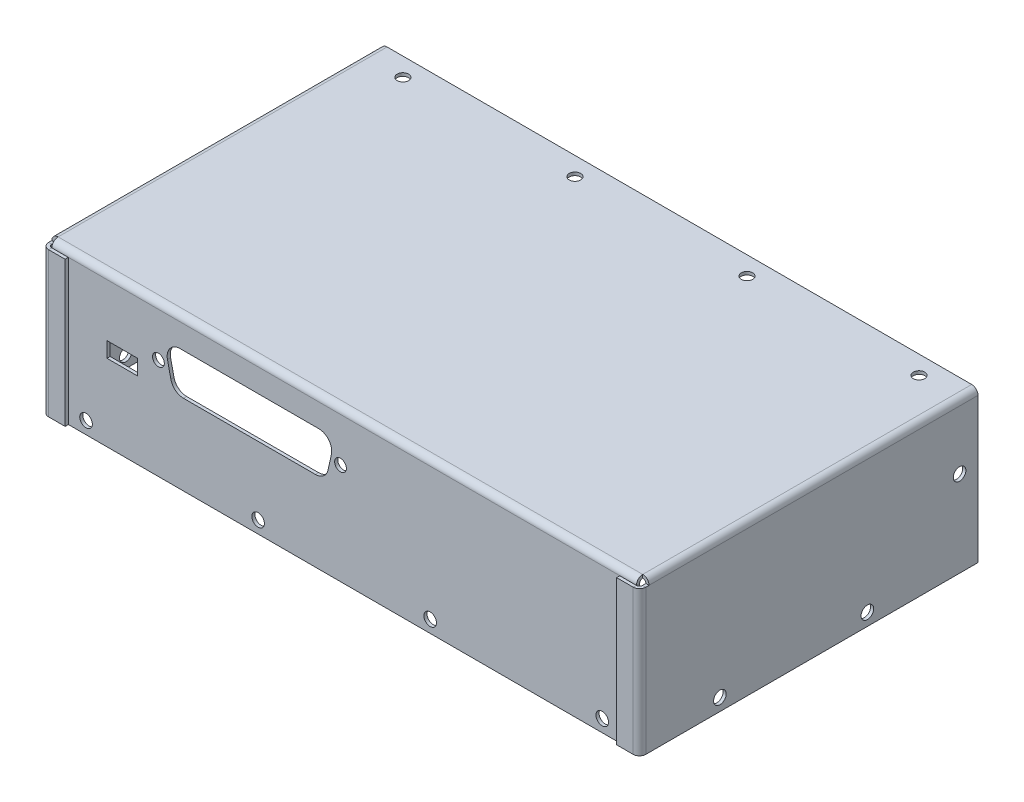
ISO-10303-21;
HEADER;
FILE_DESCRIPTION(('STEP AP214'),'2;1');
FILE_NAME('part.step','',(''),(''),'','','');
FILE_SCHEMA(('AUTOMOTIVE_DESIGN { 1 0 10303 214 1 1 1 1 }'));
ENDSEC;
DATA;
#1=APPLICATION_CONTEXT('core data for automotive mechanical design processes');
#2=APPLICATION_PROTOCOL_DEFINITION('international standard','automotive_design',2000,#1);
#3=PRODUCT_CONTEXT('',#1,'mechanical');
#4=PRODUCT('Part','Part','',(#3));
#5=PRODUCT_RELATED_PRODUCT_CATEGORY('part','',(#4));
#6=PRODUCT_DEFINITION_FORMATION('','',#4);
#7=PRODUCT_DEFINITION_CONTEXT('part definition',#1,'design');
#8=PRODUCT_DEFINITION('design','',#6,#7);
#9=PRODUCT_DEFINITION_SHAPE('','',#8);
#10=(LENGTH_UNIT() NAMED_UNIT(*) SI_UNIT(.MILLI.,.METRE.));
#11=(NAMED_UNIT(*) PLANE_ANGLE_UNIT() SI_UNIT($,.RADIAN.));
#12=(NAMED_UNIT(*) SI_UNIT($,.STERADIAN.) SOLID_ANGLE_UNIT());
#13=UNCERTAINTY_MEASURE_WITH_UNIT(LENGTH_MEASURE(1.E-05),#10,'distance_accuracy_value','');
#14=(GEOMETRIC_REPRESENTATION_CONTEXT(3) GLOBAL_UNCERTAINTY_ASSIGNED_CONTEXT((#13)) GLOBAL_UNIT_ASSIGNED_CONTEXT((#10,
#11,#12)) REPRESENTATION_CONTEXT('',''));
#15=CARTESIAN_POINT('',(0.,0.,0.));
#16=DIRECTION('',(0.,0.,1.));
#17=DIRECTION('',(1.,0.,0.));
#18=AXIS2_PLACEMENT_3D('',#15,#16,#17);
#19=CARTESIAN_POINT('',(151.0284,39.0398,-1.6256));
#20=DIRECTION('',(1.,0.,0.));
#21=DIRECTION('',(0.,0.,-1.));
#22=AXIS2_PLACEMENT_3D('',#19,#20,#21);
#23=PLANE('',#22);
#24=DIRECTION('',(0.,-1.,0.));
#25=VECTOR('',#24,1.);
#26=CARTESIAN_POINT('',(151.0284,39.0398,-1.6256));
#27=LINE('',#26,#25);
#28=CARTESIAN_POINT('',(151.0284,39.0398,-1.6256));
#29=VERTEX_POINT('',#28);
#30=CARTESIAN_POINT('',(151.0284,38.227,-1.6256));
#31=VERTEX_POINT('',#30);
#32=EDGE_CURVE('E772',#29,#31,#27,.T.);
#33=ORIENTED_EDGE('',*,*,#32,.F.);
#34=CARTESIAN_POINT('',(151.0284,37.4142,-1.6256));
#35=DIRECTION('',(1.,0.,0.));
#36=DIRECTION('',(0.,0.,-1.));
#37=AXIS2_PLACEMENT_3D('',#34,#35,#36);
#38=CIRCLE('',#37,1.6256);
#39=CARTESIAN_POINT('',(151.0284,37.4142,0.));
#40=VERTEX_POINT('',#39);
#41=EDGE_CURVE('E730',#40,#29,#38,.F.);
#42=ORIENTED_EDGE('',*,*,#41,.F.);
#43=DIRECTION('',(0.,0.,1.));
#44=VECTOR('',#43,1.);
#45=CARTESIAN_POINT('',(151.0284,37.4142,-0.8128));
#46=LINE('',#45,#44);
#47=CARTESIAN_POINT('',(151.0284,37.4142,-0.8128));
#48=VERTEX_POINT('',#47);
#49=EDGE_CURVE('E770',#48,#40,#46,.T.);
#50=ORIENTED_EDGE('',*,*,#49,.F.);
#51=CARTESIAN_POINT('',(151.0284,37.4142,-1.6256));
#52=DIRECTION('',(1.,0.,0.));
#53=DIRECTION('',(0.,0.,-1.));
#54=AXIS2_PLACEMENT_3D('',#51,#52,#53);
#55=CIRCLE('',#54,0.8128);
#56=EDGE_CURVE('E742',#48,#31,#55,.F.);
#57=ORIENTED_EDGE('',*,*,#56,.T.);
#58=EDGE_LOOP('',(#33,#42,#50,#57));
#59=FACE_BOUND('',#58,.T.);
#60=ADVANCED_FACE('F111',(#59),#23,.T.);
#61=CARTESIAN_POINT('',(0.,37.4142,0.));
#62=DIRECTION('',(-1.,0.,0.));
#63=DIRECTION('',(0.,0.,1.));
#64=AXIS2_PLACEMENT_3D('',#61,#62,#63);
#65=PLANE('',#64);
#66=DIRECTION('',(0.,0.,-1.));
#67=VECTOR('',#66,1.);
#68=CARTESIAN_POINT('',(0.,37.4142,0.));
#69=LINE('',#68,#67);
#70=CARTESIAN_POINT('',(0.,37.4142,0.));
#71=VERTEX_POINT('',#70);
#72=CARTESIAN_POINT('',(0.,37.4142,-0.8128));
#73=VERTEX_POINT('',#72);
#74=EDGE_CURVE('E768',#71,#73,#69,.T.);
#75=ORIENTED_EDGE('',*,*,#74,.F.);
#76=CARTESIAN_POINT('',(0.,37.4142,-1.6256));
#77=DIRECTION('',(1.,0.,0.));
#78=DIRECTION('',(0.,0.,-1.));
#79=AXIS2_PLACEMENT_3D('',#76,#77,#78);
#80=CIRCLE('',#79,1.6256);
#81=CARTESIAN_POINT('',(0.,39.0398,-1.6256));
#82=VERTEX_POINT('',#81);
#83=EDGE_CURVE('E707',#71,#82,#80,.F.);
#84=ORIENTED_EDGE('',*,*,#83,.T.);
#85=DIRECTION('',(0.,1.,0.));
#86=VECTOR('',#85,1.);
#87=CARTESIAN_POINT('',(0.,38.227,-1.6256));
#88=LINE('',#87,#86);
#89=CARTESIAN_POINT('',(0.,38.227,-1.6256));
#90=VERTEX_POINT('',#89);
#91=EDGE_CURVE('E765',#90,#82,#88,.T.);
#92=ORIENTED_EDGE('',*,*,#91,.F.);
#93=CARTESIAN_POINT('',(0.,37.4142,-1.6256));
#94=DIRECTION('',(1.,0.,0.));
#95=DIRECTION('',(0.,0.,-1.));
#96=AXIS2_PLACEMENT_3D('',#93,#94,#95);
#97=CIRCLE('',#96,0.8128);
#98=EDGE_CURVE('E719',#73,#90,#97,.F.);
#99=ORIENTED_EDGE('',*,*,#98,.F.);
#100=EDGE_LOOP('',(#75,#84,#92,#99));
#101=FACE_BOUND('',#100,.T.);
#102=ADVANCED_FACE('F832',(#101),#65,.T.);
#103=CARTESIAN_POINT('',(0.,38.227,-1.6256));
#104=DIRECTION('',(-1.,0.,0.));
#105=DIRECTION('',(0.,0.,1.));
#106=AXIS2_PLACEMENT_3D('',#103,#104,#105);
#107=PLANE('',#106);
#108=DIRECTION('',(0.,1.,0.));
#109=VECTOR('',#108,1.);
#110=CARTESIAN_POINT('',(0.,0.,0.));
#111=LINE('',#110,#109);
#112=CARTESIAN_POINT('',(0.,0.,0.));
#113=VERTEX_POINT('',#112);
#114=EDGE_CURVE('E710',#113,#71,#111,.T.);
#115=ORIENTED_EDGE('',*,*,#114,.T.);
#116=ORIENTED_EDGE('',*,*,#74,.T.);
#117=DIRECTION('',(0.,1.,0.));
#118=VECTOR('',#117,1.);
#119=CARTESIAN_POINT('',(0.,0.,-0.8128));
#120=LINE('',#119,#118);
#121=CARTESIAN_POINT('',(0.,0.,-0.8128));
#122=VERTEX_POINT('',#121);
#123=EDGE_CURVE('E716',#122,#73,#120,.T.);
#124=ORIENTED_EDGE('',*,*,#123,.F.);
#125=DIRECTION('',(0.,0.,1.));
#126=VECTOR('',#125,1.);
#127=CARTESIAN_POINT('',(0.,0.,-0.8128));
#128=LINE('',#127,#126);
#129=EDGE_CURVE('E713',#122,#113,#128,.T.);
#130=ORIENTED_EDGE('',*,*,#129,.T.);
#131=EDGE_LOOP('',(#115,#116,#124,#130));
#132=FACE_BOUND('',#131,.T.);
#133=ADVANCED_FACE('F839',(#132),#107,.T.);
#134=CARTESIAN_POINT('',(151.0284,38.227,0.));
#135=DIRECTION('',(0.,1.,0.));
#136=DIRECTION('',(0.,0.,1.));
#137=AXIS2_PLACEMENT_3D('',#134,#135,#136);
#138=PLANE('',#137);
#139=CARTESIAN_POINT('',(8.83919999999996,38.227,-81.8515));
#140=DIRECTION('',(0.,1.,0.));
#141=DIRECTION('',(0.,0.,1.));
#142=AXIS2_PLACEMENT_3D('',#139,#140,#141);
#143=CIRCLE('',#142,1.4732);
#144=CARTESIAN_POINT('',(8.83919999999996,38.227,-80.3783));
#145=VERTEX_POINT('',#144);
#146=EDGE_CURVE('E488',#145,#145,#143,.T.);
#147=ORIENTED_EDGE('',*,*,#146,.T.);
#148=EDGE_LOOP('',(#147));
#149=FACE_BOUND('',#148,.T.);
#150=CARTESIAN_POINT('',(53.2892,38.227,-81.8515));
#151=DIRECTION('',(0.,1.,0.));
#152=DIRECTION('',(0.,0.,1.));
#153=AXIS2_PLACEMENT_3D('',#150,#151,#152);
#154=CIRCLE('',#153,1.4732);
#155=CARTESIAN_POINT('',(53.2892,38.227,-80.3783));
#156=VERTEX_POINT('',#155);
#157=EDGE_CURVE('E494',#156,#156,#154,.T.);
#158=ORIENTED_EDGE('',*,*,#157,.T.);
#159=EDGE_LOOP('',(#158));
#160=FACE_BOUND('',#159,.T.);
#161=CARTESIAN_POINT('',(97.7392,38.227,-81.8515));
#162=DIRECTION('',(0.,1.,0.));
#163=DIRECTION('',(0.,0.,1.));
#164=AXIS2_PLACEMENT_3D('',#161,#162,#163);
#165=CIRCLE('',#164,1.4732);
#166=CARTESIAN_POINT('',(97.7392,38.227,-80.3783));
#167=VERTEX_POINT('',#166);
#168=EDGE_CURVE('E500',#167,#167,#165,.T.);
#169=ORIENTED_EDGE('',*,*,#168,.T.);
#170=EDGE_LOOP('',(#169));
#171=FACE_BOUND('',#170,.T.);
#172=CARTESIAN_POINT('',(142.1892,38.227,-81.8515));
#173=DIRECTION('',(0.,1.,0.));
#174=DIRECTION('',(0.,0.,1.));
#175=AXIS2_PLACEMENT_3D('',#172,#173,#174);
#176=CIRCLE('',#175,1.4732);
#177=CARTESIAN_POINT('',(142.1892,38.227,-80.3783));
#178=VERTEX_POINT('',#177);
#179=EDGE_CURVE('E506',#178,#178,#176,.T.);
#180=ORIENTED_EDGE('',*,*,#179,.T.);
#181=EDGE_LOOP('',(#180));
#182=FACE_BOUND('',#181,.T.);
#183=DIRECTION('',(0.,0.,-1.));
#184=VECTOR('',#183,1.);
#185=CARTESIAN_POINT('',(0.,38.227,0.));
#186=LINE('',#185,#184);
#187=CARTESIAN_POINT('',(0.,38.227,-86.614));
#188=VERTEX_POINT('',#187);
#189=EDGE_CURVE('E696',#90,#188,#186,.T.);
#190=ORIENTED_EDGE('',*,*,#189,.T.);
#191=DIRECTION('',(-1.,0.,0.));
#192=VECTOR('',#191,1.);
#193=CARTESIAN_POINT('',(151.0284,38.227,-86.614));
#194=LINE('',#193,#192);
#195=CARTESIAN_POINT('',(151.0284,38.227,-86.614));
#196=VERTEX_POINT('',#195);
#197=EDGE_CURVE('E763',#196,#188,#194,.T.);
#198=ORIENTED_EDGE('',*,*,#197,.F.);
#199=DIRECTION('',(0.,0.,-1.));
#200=VECTOR('',#199,1.);
#201=CARTESIAN_POINT('',(151.0284,38.227,0.));
#202=LINE('',#201,#200);
#203=EDGE_CURVE('E722',#31,#196,#202,.T.);
#204=ORIENTED_EDGE('',*,*,#203,.F.);
#205=DIRECTION('',(-1.,0.,0.));
#206=VECTOR('',#205,1.);
#207=CARTESIAN_POINT('',(151.0284,38.227,-1.6256));
#208=LINE('',#207,#206);
#209=EDGE_CURVE('E745',#31,#90,#208,.T.);
#210=ORIENTED_EDGE('',*,*,#209,.T.);
#211=EDGE_LOOP('',(#190,#198,#204,#210));
#212=FACE_BOUND('',#211,.T.);
#213=ADVANCED_FACE('F875',(#149,#160,#171,#182,#212),#138,.F.);
#214=CARTESIAN_POINT('',(151.0284,39.0398,-86.614));
#215=DIRECTION('',(0.,0.,-1.));
#216=DIRECTION('',(-1.,0.,0.));
#217=AXIS2_PLACEMENT_3D('',#214,#215,#216);
#218=PLANE('',#217);
#219=DIRECTION('',(0.,-1.,0.));
#220=VECTOR('',#219,1.);
#221=CARTESIAN_POINT('',(0.,39.0398,-86.614));
#222=LINE('',#221,#220);
#223=CARTESIAN_POINT('',(0.,39.0398,-86.614));
#224=VERTEX_POINT('',#223);
#225=EDGE_CURVE('E701',#224,#188,#222,.T.);
#226=ORIENTED_EDGE('',*,*,#225,.F.);
#227=DIRECTION('',(-1.,0.,0.));
#228=VECTOR('',#227,1.);
#229=CARTESIAN_POINT('',(151.0284,39.0398,-86.614));
#230=LINE('',#229,#228);
#231=CARTESIAN_POINT('',(151.0284,39.0398,-86.614));
#232=VERTEX_POINT('',#231);
#233=EDGE_CURVE('E760',#232,#224,#230,.T.);
#234=ORIENTED_EDGE('',*,*,#233,.F.);
#235=DIRECTION('',(0.,-1.,0.));
#236=VECTOR('',#235,1.);
#237=CARTESIAN_POINT('',(151.0284,39.0398,-86.614));
#238=LINE('',#237,#236);
#239=EDGE_CURVE('E724',#232,#196,#238,.T.);
#240=ORIENTED_EDGE('',*,*,#239,.T.);
#241=ORIENTED_EDGE('',*,*,#197,.T.);
#242=EDGE_LOOP('',(#226,#234,#240,#241));
#243=FACE_BOUND('',#242,.T.);
#244=ADVANCED_FACE('F934',(#243),#218,.T.);
#245=CARTESIAN_POINT('',(151.0284,39.0398,0.));
#246=DIRECTION('',(0.,1.,0.));
#247=DIRECTION('',(0.,0.,1.));
#248=AXIS2_PLACEMENT_3D('',#245,#246,#247);
#249=PLANE('',#248);
#250=CARTESIAN_POINT('',(8.83919999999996,39.0398,-81.8515));
#251=DIRECTION('',(0.,1.,0.));
#252=DIRECTION('',(0.,0.,1.));
#253=AXIS2_PLACEMENT_3D('',#250,#251,#252);
#254=CIRCLE('',#253,1.4732);
#255=CARTESIAN_POINT('',(8.83919999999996,39.0398,-80.3783));
#256=VERTEX_POINT('',#255);
#257=EDGE_CURVE('E485',#256,#256,#254,.T.);
#258=ORIENTED_EDGE('',*,*,#257,.F.);
#259=EDGE_LOOP('',(#258));
#260=FACE_BOUND('',#259,.T.);
#261=CARTESIAN_POINT('',(53.2892,39.0398,-81.8515));
#262=DIRECTION('',(0.,1.,0.));
#263=DIRECTION('',(0.,0.,1.));
#264=AXIS2_PLACEMENT_3D('',#261,#262,#263);
#265=CIRCLE('',#264,1.4732);
#266=CARTESIAN_POINT('',(53.2892,39.0398,-80.3783));
#267=VERTEX_POINT('',#266);
#268=EDGE_CURVE('E491',#267,#267,#265,.T.);
#269=ORIENTED_EDGE('',*,*,#268,.F.);
#270=EDGE_LOOP('',(#269));
#271=FACE_BOUND('',#270,.T.);
#272=CARTESIAN_POINT('',(97.7392,39.0398,-81.8515));
#273=DIRECTION('',(0.,1.,0.));
#274=DIRECTION('',(0.,0.,1.));
#275=AXIS2_PLACEMENT_3D('',#272,#273,#274);
#276=CIRCLE('',#275,1.4732);
#277=CARTESIAN_POINT('',(97.7392,39.0398,-80.3783));
#278=VERTEX_POINT('',#277);
#279=EDGE_CURVE('E497',#278,#278,#276,.T.);
#280=ORIENTED_EDGE('',*,*,#279,.F.);
#281=EDGE_LOOP('',(#280));
#282=FACE_BOUND('',#281,.T.);
#283=CARTESIAN_POINT('',(142.1892,39.0398,-81.8515));
#284=DIRECTION('',(0.,1.,0.));
#285=DIRECTION('',(0.,0.,1.));
#286=AXIS2_PLACEMENT_3D('',#283,#284,#285);
#287=CIRCLE('',#286,1.4732);
#288=CARTESIAN_POINT('',(142.1892,39.0398,-80.3783));
#289=VERTEX_POINT('',#288);
#290=EDGE_CURVE('E503',#289,#289,#287,.T.);
#291=ORIENTED_EDGE('',*,*,#290,.F.);
#292=EDGE_LOOP('',(#291));
#293=FACE_BOUND('',#292,.T.);
#294=DIRECTION('',(0.,0.,-1.));
#295=VECTOR('',#294,1.);
#296=CARTESIAN_POINT('',(0.,39.0398,0.));
#297=LINE('',#296,#295);
#298=EDGE_CURVE('E704',#82,#224,#297,.T.);
#299=ORIENTED_EDGE('',*,*,#298,.F.);
#300=DIRECTION('',(-1.,0.,0.));
#301=VECTOR('',#300,1.);
#302=CARTESIAN_POINT('',(151.0284,39.0398,-1.6256));
#303=LINE('',#302,#301);
#304=EDGE_CURVE('E758',#29,#82,#303,.T.);
#305=ORIENTED_EDGE('',*,*,#304,.F.);
#306=DIRECTION('',(0.,0.,-1.));
#307=VECTOR('',#306,1.);
#308=CARTESIAN_POINT('',(151.0284,39.0398,0.));
#309=LINE('',#308,#307);
#310=EDGE_CURVE('E727',#29,#232,#309,.T.);
#311=ORIENTED_EDGE('',*,*,#310,.T.);
#312=ORIENTED_EDGE('',*,*,#233,.T.);
#313=EDGE_LOOP('',(#299,#305,#311,#312));
#314=FACE_BOUND('',#313,.T.);
#315=ADVANCED_FACE('F850',(#260,#271,#282,#293,#314),#249,.T.);
#316=CARTESIAN_POINT('',(151.0284,37.4142,-1.6256));
#317=DIRECTION('',(-1.,0.,0.));
#318=DIRECTION('',(0.,0.,1.));
#319=AXIS2_PLACEMENT_3D('',#316,#317,#318);
#320=CYLINDRICAL_SURFACE('',#319,1.6256);
#321=ORIENTED_EDGE('',*,*,#83,.F.);
#322=DIRECTION('',(-1.,0.,0.));
#323=VECTOR('',#322,1.);
#324=CARTESIAN_POINT('',(151.0284,37.4142,0.));
#325=LINE('',#324,#323);
#326=EDGE_CURVE('E755',#40,#71,#325,.T.);
#327=ORIENTED_EDGE('',*,*,#326,.F.);
#328=ORIENTED_EDGE('',*,*,#41,.T.);
#329=ORIENTED_EDGE('',*,*,#304,.T.);
#330=EDGE_LOOP('',(#321,#327,#328,#329));
#331=FACE_BOUND('',#330,.T.);
#332=ADVANCED_FACE('F854',(#331),#320,.T.);
#333=CARTESIAN_POINT('',(151.0284,0.,0.));
#334=DIRECTION('',(0.,0.,1.));
#335=DIRECTION('',(1.,0.,0.));
#336=AXIS2_PLACEMENT_3D('',#333,#334,#335);
#337=PLANE('',#336);
#338=DIRECTION('',(0.,-1.,0.));
#339=VECTOR('',#338,1.);
#340=CARTESIAN_POINT('',(14.2494000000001,23.7744,0.));
#341=LINE('',#340,#339);
#342=CARTESIAN_POINT('',(14.2494000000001,23.7744,0.));
#343=VERTEX_POINT('',#342);
#344=CARTESIAN_POINT('',(14.2494000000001,19.812,0.));
#345=VERTEX_POINT('',#344);
#346=EDGE_CURVE('E125',#343,#345,#341,.T.);
#347=ORIENTED_EDGE('',*,*,#346,.F.);
#348=DIRECTION('',(-1.,0.,0.));
#349=VECTOR('',#348,1.);
#350=CARTESIAN_POINT('',(14.2494000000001,23.7744,0.));
#351=LINE('',#350,#349);
#352=CARTESIAN_POINT('',(22.1234000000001,23.7744,0.));
#353=VERTEX_POINT('',#352);
#354=EDGE_CURVE('E374',#353,#343,#351,.T.);
#355=ORIENTED_EDGE('',*,*,#354,.F.);
#356=DIRECTION('',(0.,1.,0.));
#357=VECTOR('',#356,1.);
#358=CARTESIAN_POINT('',(22.1234000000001,23.7744,0.));
#359=LINE('',#358,#357);
#360=CARTESIAN_POINT('',(22.1234000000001,19.812,0.));
#361=VERTEX_POINT('',#360);
#362=EDGE_CURVE('E358',#361,#353,#359,.T.);
#363=ORIENTED_EDGE('',*,*,#362,.F.);
#364=DIRECTION('',(1.,0.,0.));
#365=VECTOR('',#364,1.);
#366=CARTESIAN_POINT('',(14.2494000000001,19.812,0.));
#367=LINE('',#366,#365);
#368=EDGE_CURVE('E367',#345,#361,#367,.T.);
#369=ORIENTED_EDGE('',*,*,#368,.F.);
#370=EDGE_LOOP('',(#347,#355,#363,#369));
#371=FACE_BOUND('',#370,.T.);
#372=CARTESIAN_POINT('',(27.5336000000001,26.0858,0.));
#373=DIRECTION('',(0.,0.,1.));
#374=DIRECTION('',(1.,0.,0.));
#375=AXIS2_PLACEMENT_3D('',#372,#373,#374);
#376=CIRCLE('',#375,1.524);
#377=CARTESIAN_POINT('',(29.0576000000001,26.0858,0.));
#378=VERTEX_POINT('',#377);
#379=EDGE_CURVE('E381',#378,#378,#376,.T.);
#380=ORIENTED_EDGE('',*,*,#379,.F.);
#381=EDGE_LOOP('',(#380));
#382=FACE_BOUND('',#381,.T.);
#383=CARTESIAN_POINT('',(74.5744000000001,26.0858,0.));
#384=DIRECTION('',(0.,0.,1.));
#385=DIRECTION('',(1.,0.,0.));
#386=AXIS2_PLACEMENT_3D('',#383,#384,#385);
#387=CIRCLE('',#386,1.52399999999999);
#388=CARTESIAN_POINT('',(76.0984000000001,26.0858,0.));
#389=VERTEX_POINT('',#388);
#390=EDGE_CURVE('E387',#389,#389,#387,.T.);
#391=ORIENTED_EDGE('',*,*,#390,.F.);
#392=EDGE_LOOP('',(#391));
#393=FACE_BOUND('',#392,.T.);
#394=CARTESIAN_POINT('',(68.0847000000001,24.1046,0.));
#395=DIRECTION('',(0.,0.,1.));
#396=DIRECTION('',(-1.,0.,0.));
#397=AXIS2_PLACEMENT_3D('',#394,#395,#396);
#398=CIRCLE('',#397,3.3528);
#399=CARTESIAN_POINT('',(68.0847000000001,20.7518,0.));
#400=VERTEX_POINT('',#399);
#401=CARTESIAN_POINT('',(71.3583989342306,23.3806088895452,0.));
#402=VERTEX_POINT('',#401);
#403=EDGE_CURVE('E391',#400,#402,#398,.T.);
#404=ORIENTED_EDGE('',*,*,#403,.F.);
#405=DIRECTION('',(1.,0.,0.));
#406=VECTOR('',#405,1.);
#407=CARTESIAN_POINT('',(34.0233000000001,20.7518,0.));
#408=LINE('',#407,#406);
#409=CARTESIAN_POINT('',(34.0233000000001,20.7518,0.));
#410=VERTEX_POINT('',#409);
#411=EDGE_CURVE('E411',#410,#400,#408,.T.);
#412=ORIENTED_EDGE('',*,*,#411,.F.);
#413=CARTESIAN_POINT('',(34.0233000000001,24.1046,0.));
#414=DIRECTION('',(0.,0.,1.));
#415=DIRECTION('',(1.,0.,0.));
#416=AXIS2_PLACEMENT_3D('',#413,#414,#415);
#417=CIRCLE('',#416,3.3528);
#418=CARTESIAN_POINT('',(30.7496010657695,23.3806088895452,0.));
#419=VERTEX_POINT('',#418);
#420=EDGE_CURVE('E408',#419,#410,#417,.T.);
#421=ORIENTED_EDGE('',*,*,#420,.F.);
#422=DIRECTION('',(0.215936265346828,-0.97640746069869,0.));
#423=VECTOR('',#422,1.);
#424=CARTESIAN_POINT('',(29.8733010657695,27.3430088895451,0.));
#425=LINE('',#424,#423);
#426=CARTESIAN_POINT('',(29.8733010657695,27.3430088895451,0.));
#427=VERTEX_POINT('',#426);
#428=EDGE_CURVE('E405',#427,#419,#425,.T.);
#429=ORIENTED_EDGE('',*,*,#428,.F.);
#430=CARTESIAN_POINT('',(33.1470000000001,28.067,0.));
#431=DIRECTION('',(0.,0.,1.));
#432=DIRECTION('',(-1.,0.,0.));
#433=AXIS2_PLACEMENT_3D('',#430,#431,#432);
#434=CIRCLE('',#433,3.3528);
#435=CARTESIAN_POINT('',(33.1470000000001,31.4198,0.));
#436=VERTEX_POINT('',#435);
#437=EDGE_CURVE('E402',#436,#427,#434,.T.);
#438=ORIENTED_EDGE('',*,*,#437,.F.);
#439=DIRECTION('',(-1.,0.,0.));
#440=VECTOR('',#439,1.);
#441=CARTESIAN_POINT('',(68.9610000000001,31.4198,0.));
#442=LINE('',#441,#440);
#443=CARTESIAN_POINT('',(68.9610000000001,31.4198,0.));
#444=VERTEX_POINT('',#443);
#445=EDGE_CURVE('E399',#444,#436,#442,.T.);
#446=ORIENTED_EDGE('',*,*,#445,.F.);
#447=CARTESIAN_POINT('',(68.9610000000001,28.067,0.));
#448=DIRECTION('',(0.,0.,1.));
#449=DIRECTION('',(-1.,0.,0.));
#450=AXIS2_PLACEMENT_3D('',#447,#448,#449);
#451=CIRCLE('',#450,3.3528);
#452=CARTESIAN_POINT('',(72.2346989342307,27.3430088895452,0.));
#453=VERTEX_POINT('',#452);
#454=EDGE_CURVE('E396',#453,#444,#451,.T.);
#455=ORIENTED_EDGE('',*,*,#454,.F.);
#456=DIRECTION('',(0.215936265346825,0.976407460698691,0.));
#457=VECTOR('',#456,1.);
#458=CARTESIAN_POINT('',(71.3583989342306,23.3806088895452,0.));
#459=LINE('',#458,#457);
#460=EDGE_CURVE('E393',#402,#453,#459,.T.);
#461=ORIENTED_EDGE('',*,*,#460,.F.);
#462=EDGE_LOOP('',(#404,#412,#421,#429,#438,#446,#455,#461));
#463=FACE_BOUND('',#462,.T.);
#464=CARTESIAN_POINT('',(142.1892,3.17499999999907,0.));
#465=DIRECTION('',(0.,0.,1.));
#466=DIRECTION('',(1.,0.,0.));
#467=AXIS2_PLACEMENT_3D('',#464,#465,#466);
#468=CIRCLE('',#467,1.63195);
#469=CARTESIAN_POINT('',(143.82115,3.17499999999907,0.));
#470=VERTEX_POINT('',#469);
#471=EDGE_CURVE('E464',#470,#470,#468,.T.);
#472=ORIENTED_EDGE('',*,*,#471,.F.);
#473=EDGE_LOOP('',(#472));
#474=FACE_BOUND('',#473,.T.);
#475=CARTESIAN_POINT('',(97.7392,3.17499999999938,0.));
#476=DIRECTION('',(0.,0.,1.));
#477=DIRECTION('',(1.,0.,0.));
#478=AXIS2_PLACEMENT_3D('',#475,#476,#477);
#479=CIRCLE('',#478,1.63194999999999);
#480=CARTESIAN_POINT('',(99.37115,3.17499999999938,0.));
#481=VERTEX_POINT('',#480);
#482=EDGE_CURVE('E470',#481,#481,#479,.T.);
#483=ORIENTED_EDGE('',*,*,#482,.F.);
#484=EDGE_LOOP('',(#483));
#485=FACE_BOUND('',#484,.T.);
#486=CARTESIAN_POINT('',(53.2892,3.17499999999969,0.));
#487=DIRECTION('',(0.,0.,1.));
#488=DIRECTION('',(1.,0.,0.));
#489=AXIS2_PLACEMENT_3D('',#486,#487,#488);
#490=CIRCLE('',#489,1.63195);
#491=CARTESIAN_POINT('',(54.92115,3.17499999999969,0.));
#492=VERTEX_POINT('',#491);
#493=EDGE_CURVE('E476',#492,#492,#490,.T.);
#494=ORIENTED_EDGE('',*,*,#493,.F.);
#495=EDGE_LOOP('',(#494));
#496=FACE_BOUND('',#495,.T.);
#497=CARTESIAN_POINT('',(8.83919999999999,3.175,0.));
#498=DIRECTION('',(0.,0.,1.));
#499=DIRECTION('',(1.,0.,0.));
#500=AXIS2_PLACEMENT_3D('',#497,#498,#499);
#501=CIRCLE('',#500,1.63195);
#502=CARTESIAN_POINT('',(10.47115,3.175,0.));
#503=VERTEX_POINT('',#502);
#504=EDGE_CURVE('E482',#503,#503,#501,.T.);
#505=ORIENTED_EDGE('',*,*,#504,.F.);
#506=EDGE_LOOP('',(#505));
#507=FACE_BOUND('',#506,.T.);
#508=ORIENTED_EDGE('',*,*,#114,.F.);
#509=DIRECTION('',(-1.,0.,0.));
#510=VECTOR('',#509,1.);
#511=CARTESIAN_POINT('',(151.0284,0.,0.));
#512=LINE('',#511,#510);
#513=CARTESIAN_POINT('',(151.0284,0.,0.));
#514=VERTEX_POINT('',#513);
#515=EDGE_CURVE('E753',#514,#113,#512,.T.);
#516=ORIENTED_EDGE('',*,*,#515,.F.);
#517=DIRECTION('',(0.,1.,0.));
#518=VECTOR('',#517,1.);
#519=CARTESIAN_POINT('',(151.0284,0.,0.));
#520=LINE('',#519,#518);
#521=EDGE_CURVE('E733',#514,#40,#520,.T.);
#522=ORIENTED_EDGE('',*,*,#521,.T.);
#523=ORIENTED_EDGE('',*,*,#326,.T.);
#524=EDGE_LOOP('',(#508,#516,#522,#523));
#525=FACE_BOUND('',#524,.T.);
#526=ADVANCED_FACE('F371',(#371,#382,#393,#463,#474,#485,#496,#507,#525),#337,.T.);
#527=CARTESIAN_POINT('',(151.0284,0.,-0.8128));
#528=DIRECTION('',(0.,-1.,0.));
#529=DIRECTION('',(0.,0.,-1.));
#530=AXIS2_PLACEMENT_3D('',#527,#528,#529);
#531=PLANE('',#530);
#532=ORIENTED_EDGE('',*,*,#129,.F.);
#533=DIRECTION('',(-1.,0.,0.));
#534=VECTOR('',#533,1.);
#535=CARTESIAN_POINT('',(151.0284,0.,-0.8128));
#536=LINE('',#535,#534);
#537=CARTESIAN_POINT('',(151.0284,0.,-0.8128));
#538=VERTEX_POINT('',#537);
#539=EDGE_CURVE('E751',#538,#122,#536,.T.);
#540=ORIENTED_EDGE('',*,*,#539,.F.);
#541=DIRECTION('',(0.,0.,1.));
#542=VECTOR('',#541,1.);
#543=CARTESIAN_POINT('',(151.0284,0.,-0.8128));
#544=LINE('',#543,#542);
#545=EDGE_CURVE('E736',#538,#514,#544,.T.);
#546=ORIENTED_EDGE('',*,*,#545,.T.);
#547=ORIENTED_EDGE('',*,*,#515,.T.);
#548=EDGE_LOOP('',(#532,#540,#546,#547));
#549=FACE_BOUND('',#548,.T.);
#550=ADVANCED_FACE('F863',(#549),#531,.T.);
#551=CARTESIAN_POINT('',(151.0284,0.,-0.8128));
#552=DIRECTION('',(0.,0.,1.));
#553=DIRECTION('',(1.,0.,0.));
#554=AXIS2_PLACEMENT_3D('',#551,#552,#553);
#555=PLANE('',#554);
#556=DIRECTION('',(-1.,0.,0.));
#557=VECTOR('',#556,1.);
#558=CARTESIAN_POINT('',(151.0284,23.7744,-0.8128));
#559=LINE('',#558,#557);
#560=CARTESIAN_POINT('',(22.1234000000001,23.7744,-0.812800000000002));
#561=VERTEX_POINT('',#560);
#562=CARTESIAN_POINT('',(14.2494000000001,23.7744,-0.812800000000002));
#563=VERTEX_POINT('',#562);
#564=EDGE_CURVE('E118',#561,#563,#559,.T.);
#565=ORIENTED_EDGE('',*,*,#564,.T.);
#566=DIRECTION('',(0.,-1.,0.));
#567=VECTOR('',#566,1.);
#568=CARTESIAN_POINT('',(14.2494000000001,0.,-0.8128));
#569=LINE('',#568,#567);
#570=CARTESIAN_POINT('',(14.2494000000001,19.812,-0.812800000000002));
#571=VERTEX_POINT('',#570);
#572=EDGE_CURVE('E13',#563,#571,#569,.T.);
#573=ORIENTED_EDGE('',*,*,#572,.T.);
#574=DIRECTION('',(1.,0.,0.));
#575=VECTOR('',#574,1.);
#576=CARTESIAN_POINT('',(151.0284,19.812,-0.8128));
#577=LINE('',#576,#575);
#578=CARTESIAN_POINT('',(22.1234000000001,19.812,-0.8128));
#579=VERTEX_POINT('',#578);
#580=EDGE_CURVE('E804',#571,#579,#577,.T.);
#581=ORIENTED_EDGE('',*,*,#580,.T.);
#582=DIRECTION('',(0.,1.,0.));
#583=VECTOR('',#582,1.);
#584=CARTESIAN_POINT('',(22.1234000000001,0.,-0.8128));
#585=LINE('',#584,#583);
#586=EDGE_CURVE('E361',#579,#561,#585,.T.);
#587=ORIENTED_EDGE('',*,*,#586,.T.);
#588=EDGE_LOOP('',(#565,#573,#581,#587));
#589=FACE_BOUND('',#588,.T.);
#590=CARTESIAN_POINT('',(27.5336000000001,26.0858,-0.812800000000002));
#591=DIRECTION('',(0.,0.,1.));
#592=DIRECTION('',(1.,0.,0.));
#593=AXIS2_PLACEMENT_3D('',#590,#591,#592);
#594=CIRCLE('',#593,1.524);
#595=CARTESIAN_POINT('',(29.0576000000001,26.0858,-0.812800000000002));
#596=VERTEX_POINT('',#595);
#597=EDGE_CURVE('E386',#596,#596,#594,.T.);
#598=ORIENTED_EDGE('',*,*,#597,.T.);
#599=EDGE_LOOP('',(#598));
#600=FACE_BOUND('',#599,.T.);
#601=CARTESIAN_POINT('',(74.5744000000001,26.0858,-0.812800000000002));
#602=DIRECTION('',(0.,0.,1.));
#603=DIRECTION('',(1.,0.,0.));
#604=AXIS2_PLACEMENT_3D('',#601,#602,#603);
#605=CIRCLE('',#604,1.52399999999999);
#606=CARTESIAN_POINT('',(76.0984000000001,26.0858,-0.812800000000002));
#607=VERTEX_POINT('',#606);
#608=EDGE_CURVE('E390',#607,#607,#605,.T.);
#609=ORIENTED_EDGE('',*,*,#608,.T.);
#610=EDGE_LOOP('',(#609));
#611=FACE_BOUND('',#610,.T.);
#612=DIRECTION('',(1.,0.,0.));
#613=VECTOR('',#612,1.);
#614=CARTESIAN_POINT('',(151.0284,20.7518,-0.8128));
#615=LINE('',#614,#613);
#616=CARTESIAN_POINT('',(34.0233000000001,20.7518,-0.812800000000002));
#617=VERTEX_POINT('',#616);
#618=CARTESIAN_POINT('',(68.0847000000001,20.7518,-0.812800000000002));
#619=VERTEX_POINT('',#618);
#620=EDGE_CURVE('E798',#617,#619,#615,.T.);
#621=ORIENTED_EDGE('',*,*,#620,.T.);
#622=CARTESIAN_POINT('',(68.0847000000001,24.1046,-0.812800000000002));
#623=DIRECTION('',(0.,0.,1.));
#624=DIRECTION('',(1.,0.,0.));
#625=AXIS2_PLACEMENT_3D('',#622,#623,#624);
#626=CIRCLE('',#625,3.3528);
#627=CARTESIAN_POINT('',(71.3583989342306,23.3806088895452,-0.812800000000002));
#628=VERTEX_POINT('',#627);
#629=EDGE_CURVE('E801',#619,#628,#626,.T.);
#630=ORIENTED_EDGE('',*,*,#629,.T.);
#631=DIRECTION('',(0.215936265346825,0.976407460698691,0.));
#632=VECTOR('',#631,1.);
#633=CARTESIAN_POINT('',(70.1436800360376,17.887966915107,-0.8128));
#634=LINE('',#633,#632);
#635=CARTESIAN_POINT('',(72.2346989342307,27.3430088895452,-0.8128));
#636=VERTEX_POINT('',#635);
#637=EDGE_CURVE('E774',#628,#636,#634,.T.);
#638=ORIENTED_EDGE('',*,*,#637,.T.);
#639=CARTESIAN_POINT('',(68.9610000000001,28.067,-0.812800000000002));
#640=DIRECTION('',(0.,0.,1.));
#641=DIRECTION('',(1.,0.,0.));
#642=AXIS2_PLACEMENT_3D('',#639,#640,#641);
#643=CIRCLE('',#642,3.3528);
#644=CARTESIAN_POINT('',(68.9610000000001,31.4198,-0.812800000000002));
#645=VERTEX_POINT('',#644);
#646=EDGE_CURVE('E783',#636,#645,#643,.T.);
#647=ORIENTED_EDGE('',*,*,#646,.T.);
#648=DIRECTION('',(-1.,0.,0.));
#649=VECTOR('',#648,1.);
#650=CARTESIAN_POINT('',(151.0284,31.4198,-0.8128));
#651=LINE('',#650,#649);
#652=CARTESIAN_POINT('',(33.1470000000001,31.4198,-0.812800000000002));
#653=VERTEX_POINT('',#652);
#654=EDGE_CURVE('E786',#645,#653,#651,.T.);
#655=ORIENTED_EDGE('',*,*,#654,.T.);
#656=CARTESIAN_POINT('',(33.1470000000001,28.067,-0.812800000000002));
#657=DIRECTION('',(0.,0.,1.));
#658=DIRECTION('',(1.,0.,0.));
#659=AXIS2_PLACEMENT_3D('',#656,#657,#658);
#660=CIRCLE('',#659,3.3528);
#661=CARTESIAN_POINT('',(29.8733010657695,27.3430088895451,-0.812800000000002));
#662=VERTEX_POINT('',#661);
#663=EDGE_CURVE('E789',#653,#662,#660,.T.);
#664=ORIENTED_EDGE('',*,*,#663,.T.);
#665=DIRECTION('',(0.215936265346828,-0.97640746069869,0.));
#666=VECTOR('',#665,1.);
#667=CARTESIAN_POINT('',(41.2876267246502,-24.269594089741,-0.8128));
#668=LINE('',#667,#666);
#669=CARTESIAN_POINT('',(30.7496010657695,23.3806088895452,-0.812800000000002));
#670=VERTEX_POINT('',#669);
#671=EDGE_CURVE('E792',#662,#670,#668,.T.);
#672=ORIENTED_EDGE('',*,*,#671,.T.);
#673=CARTESIAN_POINT('',(34.0233000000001,24.1046,-0.812800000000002));
#674=DIRECTION('',(0.,0.,1.));
#675=DIRECTION('',(1.,0.,0.));
#676=AXIS2_PLACEMENT_3D('',#673,#674,#675);
#677=CIRCLE('',#676,3.3528);
#678=EDGE_CURVE('E795',#670,#617,#677,.T.);
#679=ORIENTED_EDGE('',*,*,#678,.T.);
#680=EDGE_LOOP('',(#621,#630,#638,#647,#655,#664,#672,#679));
#681=FACE_BOUND('',#680,.T.);
#682=CARTESIAN_POINT('',(142.1892,3.17499999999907,-0.8128));
#683=DIRECTION('',(0.,0.,-1.));
#684=DIRECTION('',(-1.,0.,0.));
#685=AXIS2_PLACEMENT_3D('',#682,#683,#684);
#686=CIRCLE('',#685,1.63195);
#687=CARTESIAN_POINT('',(140.55725,3.17499999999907,-0.8128));
#688=VERTEX_POINT('',#687);
#689=EDGE_CURVE('E461',#688,#688,#686,.T.);
#690=ORIENTED_EDGE('',*,*,#689,.F.);
#691=EDGE_LOOP('',(#690));
#692=FACE_BOUND('',#691,.T.);
#693=CARTESIAN_POINT('',(97.7392,3.17499999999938,-0.8128));
#694=DIRECTION('',(0.,0.,-1.));
#695=DIRECTION('',(-1.,0.,0.));
#696=AXIS2_PLACEMENT_3D('',#693,#694,#695);
#697=CIRCLE('',#696,1.63194999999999);
#698=CARTESIAN_POINT('',(96.10725,3.17499999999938,-0.8128));
#699=VERTEX_POINT('',#698);
#700=EDGE_CURVE('E467',#699,#699,#697,.T.);
#701=ORIENTED_EDGE('',*,*,#700,.F.);
#702=EDGE_LOOP('',(#701));
#703=FACE_BOUND('',#702,.T.);
#704=CARTESIAN_POINT('',(53.2892,3.17499999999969,-0.8128));
#705=DIRECTION('',(0.,0.,-1.));
#706=DIRECTION('',(-1.,0.,0.));
#707=AXIS2_PLACEMENT_3D('',#704,#705,#706);
#708=CIRCLE('',#707,1.63195);
#709=CARTESIAN_POINT('',(51.65725,3.17499999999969,-0.8128));
#710=VERTEX_POINT('',#709);
#711=EDGE_CURVE('E473',#710,#710,#708,.T.);
#712=ORIENTED_EDGE('',*,*,#711,.F.);
#713=EDGE_LOOP('',(#712));
#714=FACE_BOUND('',#713,.T.);
#715=CARTESIAN_POINT('',(8.83919999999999,3.175,-0.8128));
#716=DIRECTION('',(0.,0.,-1.));
#717=DIRECTION('',(-1.,0.,0.));
#718=AXIS2_PLACEMENT_3D('',#715,#716,#717);
#719=CIRCLE('',#718,1.63195);
#720=CARTESIAN_POINT('',(7.20724999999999,3.175,-0.8128));
#721=VERTEX_POINT('',#720);
#722=EDGE_CURVE('E479',#721,#721,#719,.T.);
#723=ORIENTED_EDGE('',*,*,#722,.F.);
#724=EDGE_LOOP('',(#723));
#725=FACE_BOUND('',#724,.T.);
#726=ORIENTED_EDGE('',*,*,#123,.T.);
#727=DIRECTION('',(-1.,0.,0.));
#728=VECTOR('',#727,1.);
#729=CARTESIAN_POINT('',(151.0284,37.4142,-0.8128));
#730=LINE('',#729,#728);
#731=EDGE_CURVE('E748',#48,#73,#730,.T.);
#732=ORIENTED_EDGE('',*,*,#731,.F.);
#733=DIRECTION('',(0.,1.,0.));
#734=VECTOR('',#733,1.);
#735=CARTESIAN_POINT('',(151.0284,0.,-0.8128));
#736=LINE('',#735,#734);
#737=EDGE_CURVE('E739',#538,#48,#736,.T.);
#738=ORIENTED_EDGE('',*,*,#737,.F.);
#739=ORIENTED_EDGE('',*,*,#539,.T.);
#740=EDGE_LOOP('',(#726,#732,#738,#739));
#741=FACE_BOUND('',#740,.T.);
#742=ADVANCED_FACE('F812',(#589,#600,#611,#681,#692,#703,#714,#725,#741),#555,.F.);
#743=CARTESIAN_POINT('',(151.0284,37.4142,-1.6256));
#744=DIRECTION('',(-1.,0.,0.));
#745=DIRECTION('',(0.,0.,1.));
#746=AXIS2_PLACEMENT_3D('',#743,#744,#745);
#747=CYLINDRICAL_SURFACE('',#746,0.8128);
#748=ORIENTED_EDGE('',*,*,#98,.T.);
#749=ORIENTED_EDGE('',*,*,#209,.F.);
#750=ORIENTED_EDGE('',*,*,#56,.F.);
#751=ORIENTED_EDGE('',*,*,#731,.T.);
#752=EDGE_LOOP('',(#748,#749,#750,#751));
#753=FACE_BOUND('',#752,.T.);
#754=ADVANCED_FACE('F870',(#753),#747,.F.);
#755=CARTESIAN_POINT('',(151.0284,37.4142,-1.6256));
#756=DIRECTION('',(1.,0.,0.));
#757=DIRECTION('',(0.,0.,-1.));
#758=AXIS2_PLACEMENT_3D('',#755,#756,#757);
#759=PLANE('',#758);
#760=ORIENTED_EDGE('',*,*,#737,.T.);
#761=ORIENTED_EDGE('',*,*,#49,.T.);
#762=ORIENTED_EDGE('',*,*,#521,.F.);
#763=ORIENTED_EDGE('',*,*,#545,.F.);
#764=EDGE_LOOP('',(#760,#761,#762,#763));
#765=FACE_BOUND('',#764,.T.);
#766=ADVANCED_FACE('F860',(#765),#759,.T.);
#767=CARTESIAN_POINT('',(151.0284,37.4142,-86.614));
#768=DIRECTION('',(0.,0.,-1.));
#769=DIRECTION('',(-1.,0.,0.));
#770=AXIS2_PLACEMENT_3D('',#767,#768,#769);
#771=PLANE('',#770);
#772=DIRECTION('',(-1.,0.,0.));
#773=VECTOR('',#772,1.);
#774=CARTESIAN_POINT('',(152.654,37.4142,-86.614));
#775=LINE('',#774,#773);
#776=CARTESIAN_POINT('',(151.8412,37.4142,-86.614));
#777=VERTEX_POINT('',#776);
#778=CARTESIAN_POINT('',(152.654,37.4142,-86.614));
#779=VERTEX_POINT('',#778);
#780=EDGE_CURVE('E662',#777,#779,#775,.F.);
#781=ORIENTED_EDGE('',*,*,#780,.F.);
#782=CARTESIAN_POINT('',(151.0284,37.4142,-86.614));
#783=DIRECTION('',(0.,0.,1.));
#784=DIRECTION('',(1.,0.,0.));
#785=AXIS2_PLACEMENT_3D('',#782,#783,#784);
#786=CIRCLE('',#785,0.812800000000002);
#787=EDGE_CURVE('E687',#196,#777,#786,.F.);
#788=ORIENTED_EDGE('',*,*,#787,.F.);
#789=ORIENTED_EDGE('',*,*,#239,.F.);
#790=CARTESIAN_POINT('',(151.0284,37.4142,-86.614));
#791=DIRECTION('',(0.,0.,1.));
#792=DIRECTION('',(1.,0.,0.));
#793=AXIS2_PLACEMENT_3D('',#790,#791,#792);
#794=CIRCLE('',#793,1.6256);
#795=EDGE_CURVE('E693',#232,#779,#794,.F.);
#796=ORIENTED_EDGE('',*,*,#795,.T.);
#797=EDGE_LOOP('',(#781,#788,#789,#796));
#798=FACE_BOUND('',#797,.T.);
#799=ADVANCED_FACE('F882',(#798),#771,.T.);
#800=CARTESIAN_POINT('',(151.0284,37.4142,-1.6256));
#801=DIRECTION('',(0.,0.,-1.));
#802=DIRECTION('',(-1.,0.,0.));
#803=AXIS2_PLACEMENT_3D('',#800,#801,#802);
#804=PLANE('',#803);
#805=CARTESIAN_POINT('',(151.0284,37.4142,-1.6256));
#806=DIRECTION('',(0.,0.,1.));
#807=DIRECTION('',(1.,0.,0.));
#808=AXIS2_PLACEMENT_3D('',#805,#806,#807);
#809=CIRCLE('',#808,0.812800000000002);
#810=CARTESIAN_POINT('',(151.8412,37.4142,-1.6256));
#811=VERTEX_POINT('',#810);
#812=EDGE_CURVE('E666',#811,#31,#809,.T.);
#813=ORIENTED_EDGE('',*,*,#812,.F.);
#814=DIRECTION('',(-1.,0.,0.));
#815=VECTOR('',#814,1.);
#816=CARTESIAN_POINT('',(151.8412,37.4142,-1.6256));
#817=LINE('',#816,#815);
#818=CARTESIAN_POINT('',(152.654,37.4142,-1.6256));
#819=VERTEX_POINT('',#818);
#820=EDGE_CURVE('E679',#811,#819,#817,.F.);
#821=ORIENTED_EDGE('',*,*,#820,.T.);
#822=CARTESIAN_POINT('',(151.0284,37.4142,-1.6256));
#823=DIRECTION('',(0.,0.,1.));
#824=DIRECTION('',(1.,0.,0.));
#825=AXIS2_PLACEMENT_3D('',#822,#823,#824);
#826=CIRCLE('',#825,1.6256);
#827=EDGE_CURVE('E690',#819,#29,#826,.T.);
#828=ORIENTED_EDGE('',*,*,#827,.T.);
#829=ORIENTED_EDGE('',*,*,#32,.T.);
#830=EDGE_LOOP('',(#813,#821,#828,#829));
#831=FACE_BOUND('',#830,.T.);
#832=ADVANCED_FACE('F903',(#831),#804,.F.);
#833=CARTESIAN_POINT('',(151.0284,37.4142,-1.6256));
#834=DIRECTION('',(0.,0.,1.));
#835=DIRECTION('',(1.,0.,0.));
#836=AXIS2_PLACEMENT_3D('',#833,#834,#835);
#837=CYLINDRICAL_SURFACE('',#836,1.6256);
#838=ORIENTED_EDGE('',*,*,#310,.F.);
#839=ORIENTED_EDGE('',*,*,#827,.F.);
#840=DIRECTION('',(0.,0.,1.));
#841=VECTOR('',#840,1.);
#842=CARTESIAN_POINT('',(152.654,37.4142,-86.614));
#843=LINE('',#842,#841);
#844=EDGE_CURVE('E677',#819,#779,#843,.F.);
#845=ORIENTED_EDGE('',*,*,#844,.T.);
#846=ORIENTED_EDGE('',*,*,#795,.F.);
#847=EDGE_LOOP('',(#838,#839,#845,#846));
#848=FACE_BOUND('',#847,.T.);
#849=ADVANCED_FACE('F908',(#848),#837,.T.);
#850=CARTESIAN_POINT('',(151.0284,37.4142,-1.6256));
#851=DIRECTION('',(0.,0.,1.));
#852=DIRECTION('',(1.,0.,0.));
#853=AXIS2_PLACEMENT_3D('',#850,#851,#852);
#854=CYLINDRICAL_SURFACE('',#853,0.812800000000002);
#855=ORIENTED_EDGE('',*,*,#203,.T.);
#856=ORIENTED_EDGE('',*,*,#787,.T.);
#857=DIRECTION('',(0.,0.,1.));
#858=VECTOR('',#857,1.);
#859=CARTESIAN_POINT('',(151.8412,37.4142,-86.614));
#860=LINE('',#859,#858);
#861=EDGE_CURVE('E682',#777,#811,#860,.T.);
#862=ORIENTED_EDGE('',*,*,#861,.T.);
#863=ORIENTED_EDGE('',*,*,#812,.T.);
#864=EDGE_LOOP('',(#855,#856,#862,#863));
#865=FACE_BOUND('',#864,.T.);
#866=ADVANCED_FACE('F878',(#865),#854,.F.);
#867=CARTESIAN_POINT('',(152.654,38.227,-86.614));
#868=DIRECTION('',(0.,0.,1.));
#869=DIRECTION('',(1.,0.,0.));
#870=AXIS2_PLACEMENT_3D('',#867,#868,#869);
#871=PLANE('',#870);
#872=ORIENTED_EDGE('',*,*,#780,.T.);
#873=DIRECTION('',(0.,1.,0.));
#874=VECTOR('',#873,1.);
#875=CARTESIAN_POINT('',(152.654,38.227,-86.614));
#876=LINE('',#875,#874);
#877=CARTESIAN_POINT('',(152.654,0.,-86.614));
#878=VERTEX_POINT('',#877);
#879=EDGE_CURVE('E667',#878,#779,#876,.T.);
#880=ORIENTED_EDGE('',*,*,#879,.F.);
#881=DIRECTION('',(-1.,0.,0.));
#882=VECTOR('',#881,1.);
#883=CARTESIAN_POINT('',(152.654,0.,-86.614));
#884=LINE('',#883,#882);
#885=CARTESIAN_POINT('',(151.8412,0.,-86.614));
#886=VERTEX_POINT('',#885);
#887=EDGE_CURVE('E663',#878,#886,#884,.T.);
#888=ORIENTED_EDGE('',*,*,#887,.T.);
#889=DIRECTION('',(0.,-1.,0.));
#890=VECTOR('',#889,1.);
#891=CARTESIAN_POINT('',(151.8412,38.227,-86.614));
#892=LINE('',#891,#890);
#893=EDGE_CURVE('E672',#886,#777,#892,.F.);
#894=ORIENTED_EDGE('',*,*,#893,.T.);
#895=EDGE_LOOP('',(#872,#880,#888,#894));
#896=FACE_BOUND('',#895,.T.);
#897=ADVANCED_FACE('F886',(#896),#871,.F.);
#898=CARTESIAN_POINT('',(152.654,38.227,-86.614));
#899=DIRECTION('',(-1.,0.,0.));
#900=DIRECTION('',(0.,-1.,0.));
#901=AXIS2_PLACEMENT_3D('',#898,#899,#900);
#902=PLANE('',#901);
#903=CARTESIAN_POINT('',(152.654,22.2249999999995,-81.8515));
#904=DIRECTION('',(-1.,0.,0.));
#905=DIRECTION('',(0.,-1.,0.));
#906=AXIS2_PLACEMENT_3D('',#903,#904,#905);
#907=CIRCLE('',#906,1.63194999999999);
#908=CARTESIAN_POINT('',(152.654,20.5930499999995,-81.8515));
#909=VERTEX_POINT('',#908);
#910=EDGE_CURVE('E434',#909,#909,#907,.T.);
#911=ORIENTED_EDGE('',*,*,#910,.T.);
#912=EDGE_LOOP('',(#911));
#913=FACE_BOUND('',#912,.T.);
#914=CARTESIAN_POINT('',(152.654,3.17499999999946,-19.939));
#915=DIRECTION('',(-1.,0.,0.));
#916=DIRECTION('',(0.,-1.,0.));
#917=AXIS2_PLACEMENT_3D('',#914,#915,#916);
#918=CIRCLE('',#917,1.63195);
#919=CARTESIAN_POINT('',(152.654,1.54304999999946,-19.939));
#920=VERTEX_POINT('',#919);
#921=EDGE_CURVE('E444',#920,#920,#918,.T.);
#922=ORIENTED_EDGE('',*,*,#921,.T.);
#923=EDGE_LOOP('',(#922));
#924=FACE_BOUND('',#923,.T.);
#925=CARTESIAN_POINT('',(152.654,3.17499999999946,-58.039));
#926=DIRECTION('',(-1.,0.,0.));
#927=DIRECTION('',(0.,-1.,0.));
#928=AXIS2_PLACEMENT_3D('',#925,#926,#927);
#929=CIRCLE('',#928,1.63195);
#930=CARTESIAN_POINT('',(152.654,1.54304999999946,-58.039));
#931=VERTEX_POINT('',#930);
#932=EDGE_CURVE('E454',#931,#931,#929,.T.);
#933=ORIENTED_EDGE('',*,*,#932,.T.);
#934=EDGE_LOOP('',(#933));
#935=FACE_BOUND('',#934,.T.);
#936=ORIENTED_EDGE('',*,*,#844,.F.);
#937=DIRECTION('',(0.,0.,-1.));
#938=VECTOR('',#937,1.);
#939=CARTESIAN_POINT('',(152.654,37.4142,-0.787400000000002));
#940=LINE('',#939,#938);
#941=CARTESIAN_POINT('',(152.654,37.4142,-0.787400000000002));
#942=VERTEX_POINT('',#941);
#943=EDGE_CURVE('E656',#942,#819,#940,.T.);
#944=ORIENTED_EDGE('',*,*,#943,.F.);
#945=DIRECTION('',(0.,1.,0.));
#946=VECTOR('',#945,1.);
#947=CARTESIAN_POINT('',(152.654,37.4142,-0.787400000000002));
#948=LINE('',#947,#946);
#949=CARTESIAN_POINT('',(152.654,0.,-0.787400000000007));
#950=VERTEX_POINT('',#949);
#951=EDGE_CURVE('E644',#942,#950,#948,.F.);
#952=ORIENTED_EDGE('',*,*,#951,.T.);
#953=DIRECTION('',(0.,0.,-1.));
#954=VECTOR('',#953,1.);
#955=CARTESIAN_POINT('',(152.654,0.,-86.614));
#956=LINE('',#955,#954);
#957=EDGE_CURVE('E670',#950,#878,#956,.T.);
#958=ORIENTED_EDGE('',*,*,#957,.T.);
#959=ORIENTED_EDGE('',*,*,#879,.T.);
#960=EDGE_LOOP('',(#936,#944,#952,#958,#959));
#961=FACE_BOUND('',#960,.T.);
#962=ADVANCED_FACE('F890',(#913,#924,#935,#961),#902,.F.);
#963=CARTESIAN_POINT('',(151.8412,38.227,-86.614));
#964=DIRECTION('',(-1.,0.,0.));
#965=DIRECTION('',(0.,-1.,0.));
#966=AXIS2_PLACEMENT_3D('',#963,#964,#965);
#967=PLANE('',#966);
#968=CARTESIAN_POINT('',(151.8412,22.2249999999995,-81.8515));
#969=DIRECTION('',(-1.,0.,0.));
#970=DIRECTION('',(0.,-1.,0.));
#971=AXIS2_PLACEMENT_3D('',#968,#969,#970);
#972=CIRCLE('',#971,1.63194999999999);
#973=CARTESIAN_POINT('',(151.8412,20.5930499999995,-81.8515));
#974=VERTEX_POINT('',#973);
#975=EDGE_CURVE('E438',#974,#974,#972,.T.);
#976=ORIENTED_EDGE('',*,*,#975,.F.);
#977=EDGE_LOOP('',(#976));
#978=FACE_BOUND('',#977,.T.);
#979=CARTESIAN_POINT('',(151.8412,3.17499999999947,-19.939));
#980=DIRECTION('',(-1.,0.,0.));
#981=DIRECTION('',(0.,-1.,0.));
#982=AXIS2_PLACEMENT_3D('',#979,#980,#981);
#983=CIRCLE('',#982,1.63195);
#984=CARTESIAN_POINT('',(151.8412,1.54304999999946,-19.939));
#985=VERTEX_POINT('',#984);
#986=EDGE_CURVE('E448',#985,#985,#983,.T.);
#987=ORIENTED_EDGE('',*,*,#986,.F.);
#988=EDGE_LOOP('',(#987));
#989=FACE_BOUND('',#988,.T.);
#990=CARTESIAN_POINT('',(151.8412,3.17499999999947,-58.039));
#991=DIRECTION('',(-1.,0.,0.));
#992=DIRECTION('',(0.,-1.,0.));
#993=AXIS2_PLACEMENT_3D('',#990,#991,#992);
#994=CIRCLE('',#993,1.63195);
#995=CARTESIAN_POINT('',(151.8412,1.54304999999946,-58.039));
#996=VERTEX_POINT('',#995);
#997=EDGE_CURVE('E458',#996,#996,#994,.T.);
#998=ORIENTED_EDGE('',*,*,#997,.F.);
#999=EDGE_LOOP('',(#998));
#1000=FACE_BOUND('',#999,.T.);
#1001=DIRECTION('',(0.,0.,1.));
#1002=VECTOR('',#1001,1.);
#1003=CARTESIAN_POINT('',(151.8412,0.,-86.614));
#1004=LINE('',#1003,#1002);
#1005=CARTESIAN_POINT('',(151.8412,0.,-0.787400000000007));
#1006=VERTEX_POINT('',#1005);
#1007=EDGE_CURVE('E675',#1006,#886,#1004,.F.);
#1008=ORIENTED_EDGE('',*,*,#1007,.F.);
#1009=DIRECTION('',(0.,1.,0.));
#1010=VECTOR('',#1009,1.);
#1011=CARTESIAN_POINT('',(151.8412,37.4142,-0.787400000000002));
#1012=LINE('',#1011,#1010);
#1013=CARTESIAN_POINT('',(151.8412,37.4142,-0.787400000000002));
#1014=VERTEX_POINT('',#1013);
#1015=EDGE_CURVE('E640',#1014,#1006,#1012,.F.);
#1016=ORIENTED_EDGE('',*,*,#1015,.F.);
#1017=DIRECTION('',(0.,0.,-1.));
#1018=VECTOR('',#1017,1.);
#1019=CARTESIAN_POINT('',(151.8412,37.4142,-0.787400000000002));
#1020=LINE('',#1019,#1018);
#1021=EDGE_CURVE('E660',#1014,#811,#1020,.T.);
#1022=ORIENTED_EDGE('',*,*,#1021,.T.);
#1023=ORIENTED_EDGE('',*,*,#861,.F.);
#1024=ORIENTED_EDGE('',*,*,#893,.F.);
#1025=EDGE_LOOP('',(#1008,#1016,#1022,#1023,#1024));
#1026=FACE_BOUND('',#1025,.T.);
#1027=ADVANCED_FACE('F899',(#978,#989,#1000,#1026),#967,.T.);
#1028=CARTESIAN_POINT('',(152.654,0.,-86.614));
#1029=DIRECTION('',(0.,1.,0.));
#1030=DIRECTION('',(-1.,0.,0.));
#1031=AXIS2_PLACEMENT_3D('',#1028,#1029,#1030);
#1032=PLANE('',#1031);
#1033=ORIENTED_EDGE('',*,*,#1007,.T.);
#1034=ORIENTED_EDGE('',*,*,#887,.F.);
#1035=ORIENTED_EDGE('',*,*,#957,.F.);
#1036=DIRECTION('',(1.,0.,0.));
#1037=VECTOR('',#1036,1.);
#1038=CARTESIAN_POINT('',(151.8412,0.,-0.787400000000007));
#1039=LINE('',#1038,#1037);
#1040=EDGE_CURVE('E653',#1006,#950,#1039,.T.);
#1041=ORIENTED_EDGE('',*,*,#1040,.F.);
#1042=EDGE_LOOP('',(#1033,#1034,#1035,#1041));
#1043=FACE_BOUND('',#1042,.T.);
#1044=ADVANCED_FACE('F896',(#1043),#1032,.F.);
#1045=CARTESIAN_POINT('',(151.8412,37.4142,-0.787400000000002));
#1046=DIRECTION('',(0.,1.,0.));
#1047=DIRECTION('',(1.,0.,0.));
#1048=AXIS2_PLACEMENT_3D('',#1045,#1046,#1047);
#1049=PLANE('',#1048);
#1050=ORIENTED_EDGE('',*,*,#1021,.F.);
#1051=DIRECTION('',(1.,0.,0.));
#1052=VECTOR('',#1051,1.);
#1053=CARTESIAN_POINT('',(151.8412,37.4142,-0.787400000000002));
#1054=LINE('',#1053,#1052);
#1055=EDGE_CURVE('E650',#1014,#942,#1054,.T.);
#1056=ORIENTED_EDGE('',*,*,#1055,.T.);
#1057=ORIENTED_EDGE('',*,*,#943,.T.);
#1058=ORIENTED_EDGE('',*,*,#820,.F.);
#1059=EDGE_LOOP('',(#1050,#1056,#1057,#1058));
#1060=FACE_BOUND('',#1059,.T.);
#1061=ADVANCED_FACE('F906',(#1060),#1049,.T.);
#1062=CARTESIAN_POINT('',(151.0284,0.,-0.787400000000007));
#1063=DIRECTION('',(0.,-1.,0.));
#1064=DIRECTION('',(0.,0.,-1.));
#1065=AXIS2_PLACEMENT_3D('',#1062,#1063,#1064);
#1066=PLANE('',#1065);
#1067=DIRECTION('',(0.,0.,-1.));
#1068=VECTOR('',#1067,1.);
#1069=CARTESIAN_POINT('',(151.0284,0.,0.838199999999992));
#1070=LINE('',#1069,#1068);
#1071=CARTESIAN_POINT('',(151.0284,0.,0.0253999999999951));
#1072=VERTEX_POINT('',#1071);
#1073=CARTESIAN_POINT('',(151.0284,0.,0.838199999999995));
#1074=VERTEX_POINT('',#1073);
#1075=EDGE_CURVE('E602',#1072,#1074,#1070,.F.);
#1076=ORIENTED_EDGE('',*,*,#1075,.F.);
#1077=CARTESIAN_POINT('',(151.0284,0.,-0.787400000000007));
#1078=DIRECTION('',(0.,1.,0.));
#1079=DIRECTION('',(0.,0.,1.));
#1080=AXIS2_PLACEMENT_3D('',#1077,#1078,#1079);
#1081=CIRCLE('',#1080,0.812800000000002);
#1082=EDGE_CURVE('E636',#1006,#1072,#1081,.F.);
#1083=ORIENTED_EDGE('',*,*,#1082,.F.);
#1084=ORIENTED_EDGE('',*,*,#1040,.T.);
#1085=CARTESIAN_POINT('',(151.0284,0.,-0.787400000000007));
#1086=DIRECTION('',(0.,1.,0.));
#1087=DIRECTION('',(0.,0.,1.));
#1088=AXIS2_PLACEMENT_3D('',#1085,#1086,#1087);
#1089=CIRCLE('',#1088,1.6256);
#1090=EDGE_CURVE('E647',#950,#1074,#1089,.F.);
#1091=ORIENTED_EDGE('',*,*,#1090,.T.);
#1092=EDGE_LOOP('',(#1076,#1083,#1084,#1091));
#1093=FACE_BOUND('',#1092,.T.);
#1094=ADVANCED_FACE('F1079',(#1093),#1066,.T.);
#1095=CARTESIAN_POINT('',(151.0284,37.4142,-0.787400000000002));
#1096=DIRECTION('',(0.,-1.,0.));
#1097=DIRECTION('',(0.,0.,-1.));
#1098=AXIS2_PLACEMENT_3D('',#1095,#1096,#1097);
#1099=PLANE('',#1098);
#1100=CARTESIAN_POINT('',(151.0284,37.4142,-0.787400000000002));
#1101=DIRECTION('',(0.,1.,0.));
#1102=DIRECTION('',(0.,0.,1.));
#1103=AXIS2_PLACEMENT_3D('',#1100,#1101,#1102);
#1104=CIRCLE('',#1103,0.812800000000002);
#1105=CARTESIAN_POINT('',(151.0284,37.4142,0.0254000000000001));
#1106=VERTEX_POINT('',#1105);
#1107=EDGE_CURVE('E608',#1106,#1014,#1104,.T.);
#1108=ORIENTED_EDGE('',*,*,#1107,.F.);
#1109=DIRECTION('',(0.,0.,-1.));
#1110=VECTOR('',#1109,1.);
#1111=CARTESIAN_POINT('',(151.0284,37.4142,0.0253999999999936));
#1112=LINE('',#1111,#1110);
#1113=CARTESIAN_POINT('',(151.0284,37.4142,0.838199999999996));
#1114=VERTEX_POINT('',#1113);
#1115=EDGE_CURVE('E629',#1106,#1114,#1112,.F.);
#1116=ORIENTED_EDGE('',*,*,#1115,.T.);
#1117=CARTESIAN_POINT('',(151.0284,37.4142,-0.787400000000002));
#1118=DIRECTION('',(0.,1.,0.));
#1119=DIRECTION('',(0.,0.,1.));
#1120=AXIS2_PLACEMENT_3D('',#1117,#1118,#1119);
#1121=CIRCLE('',#1120,1.6256);
#1122=EDGE_CURVE('E639',#1114,#942,#1121,.T.);
#1123=ORIENTED_EDGE('',*,*,#1122,.T.);
#1124=ORIENTED_EDGE('',*,*,#1055,.F.);
#1125=EDGE_LOOP('',(#1108,#1116,#1123,#1124));
#1126=FACE_BOUND('',#1125,.T.);
#1127=ADVANCED_FACE('F1075',(#1126),#1099,.F.);
#1128=CARTESIAN_POINT('',(151.0284,37.4142,-0.787400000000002));
#1129=DIRECTION('',(0.,1.,0.));
#1130=DIRECTION('',(0.,0.,1.));
#1131=AXIS2_PLACEMENT_3D('',#1128,#1129,#1130);
#1132=CYLINDRICAL_SURFACE('',#1131,1.6256);
#1133=ORIENTED_EDGE('',*,*,#951,.F.);
#1134=ORIENTED_EDGE('',*,*,#1122,.F.);
#1135=DIRECTION('',(0.,1.,0.));
#1136=VECTOR('',#1135,1.);
#1137=CARTESIAN_POINT('',(151.0284,37.4142,0.838199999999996));
#1138=LINE('',#1137,#1136);
#1139=EDGE_CURVE('E626',#1074,#1114,#1138,.T.);
#1140=ORIENTED_EDGE('',*,*,#1139,.F.);
#1141=ORIENTED_EDGE('',*,*,#1090,.F.);
#1142=EDGE_LOOP('',(#1133,#1134,#1140,#1141));
#1143=FACE_BOUND('',#1142,.T.);
#1144=ADVANCED_FACE('F1073',(#1143),#1132,.T.);
#1145=CARTESIAN_POINT('',(151.0284,37.4142,-0.787400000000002));
#1146=DIRECTION('',(0.,1.,0.));
#1147=DIRECTION('',(0.,0.,1.));
#1148=AXIS2_PLACEMENT_3D('',#1145,#1146,#1147);
#1149=CYLINDRICAL_SURFACE('',#1148,0.812800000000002);
#1150=ORIENTED_EDGE('',*,*,#1015,.T.);
#1151=ORIENTED_EDGE('',*,*,#1082,.T.);
#1152=DIRECTION('',(0.,-1.,0.));
#1153=VECTOR('',#1152,1.);
#1154=CARTESIAN_POINT('',(151.0284,2.72156319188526E-13,0.0253999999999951));
#1155=LINE('',#1154,#1153);
#1156=EDGE_CURVE('E632',#1072,#1106,#1155,.F.);
#1157=ORIENTED_EDGE('',*,*,#1156,.T.);
#1158=ORIENTED_EDGE('',*,*,#1107,.T.);
#1159=EDGE_LOOP('',(#1150,#1151,#1157,#1158));
#1160=FACE_BOUND('',#1159,.T.);
#1161=ADVANCED_FACE('F1069',(#1160),#1149,.F.);
#1162=CARTESIAN_POINT('',(146.7612,37.4142,0.838200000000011));
#1163=DIRECTION('',(0.,-1.,0.));
#1164=DIRECTION('',(1.,0.,0.));
#1165=AXIS2_PLACEMENT_3D('',#1162,#1163,#1164);
#1166=PLANE('',#1165);
#1167=ORIENTED_EDGE('',*,*,#1115,.F.);
#1168=DIRECTION('',(-1.,0.,0.));
#1169=VECTOR('',#1168,1.);
#1170=CARTESIAN_POINT('',(146.7612,37.4142,0.0254000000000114));
#1171=LINE('',#1170,#1169);
#1172=CARTESIAN_POINT('',(146.7612,37.4142,0.0254000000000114));
#1173=VERTEX_POINT('',#1172);
#1174=EDGE_CURVE('E624',#1106,#1173,#1171,.T.);
#1175=ORIENTED_EDGE('',*,*,#1174,.T.);
#1176=DIRECTION('',(0.,0.,-1.));
#1177=VECTOR('',#1176,1.);
#1178=CARTESIAN_POINT('',(146.7612,37.4142,0.838200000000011));
#1179=LINE('',#1178,#1177);
#1180=CARTESIAN_POINT('',(146.7612,37.4142,0.838200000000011));
#1181=VERTEX_POINT('',#1180);
#1182=EDGE_CURVE('E605',#1181,#1173,#1179,.T.);
#1183=ORIENTED_EDGE('',*,*,#1182,.F.);
#1184=DIRECTION('',(1.,0.,0.));
#1185=VECTOR('',#1184,1.);
#1186=CARTESIAN_POINT('',(151.8412,37.4142,0.838199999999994));
#1187=LINE('',#1186,#1185);
#1188=EDGE_CURVE('E617',#1114,#1181,#1187,.F.);
#1189=ORIENTED_EDGE('',*,*,#1188,.F.);
#1190=EDGE_LOOP('',(#1167,#1175,#1183,#1189));
#1191=FACE_BOUND('',#1190,.T.);
#1192=ADVANCED_FACE('F1062',(#1191),#1166,.F.);
#1193=CARTESIAN_POINT('',(151.8412,0.,0.838199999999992));
#1194=DIRECTION('',(1.07170786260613E-13,1.,0.));
#1195=DIRECTION('',(-1.,1.07170786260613E-13,0.));
#1196=AXIS2_PLACEMENT_3D('',#1193,#1194,#1195);
#1197=PLANE('',#1196);
#1198=ORIENTED_EDGE('',*,*,#1075,.T.);
#1199=DIRECTION('',(-1.,1.07170786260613E-13,0.));
#1200=VECTOR('',#1199,1.);
#1201=CARTESIAN_POINT('',(151.841199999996,0.,0.838199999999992));
#1202=LINE('',#1201,#1200);
#1203=CARTESIAN_POINT('',(146.7612,5.43586288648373E-13,0.83820000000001));
#1204=VERTEX_POINT('',#1203);
#1205=EDGE_CURVE('E612',#1204,#1074,#1202,.F.);
#1206=ORIENTED_EDGE('',*,*,#1205,.F.);
#1207=DIRECTION('',(0.,0.,-1.));
#1208=VECTOR('',#1207,1.);
#1209=CARTESIAN_POINT('',(146.7612,5.44341917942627E-13,0.83820000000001));
#1210=LINE('',#1209,#1208);
#1211=CARTESIAN_POINT('',(146.7612,5.44370182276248E-13,0.02540000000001));
#1212=VERTEX_POINT('',#1211);
#1213=EDGE_CURVE('E609',#1204,#1212,#1210,.T.);
#1214=ORIENTED_EDGE('',*,*,#1213,.T.);
#1215=DIRECTION('',(1.,-1.07170786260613E-13,0.));
#1216=VECTOR('',#1215,1.);
#1217=CARTESIAN_POINT('',(151.8412,0.,0.0253999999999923));
#1218=LINE('',#1217,#1216);
#1219=EDGE_CURVE('E619',#1212,#1072,#1218,.T.);
#1220=ORIENTED_EDGE('',*,*,#1219,.T.);
#1221=EDGE_LOOP('',(#1198,#1206,#1214,#1220));
#1222=FACE_BOUND('',#1221,.T.);
#1223=ADVANCED_FACE('F1058',(#1222),#1197,.F.);
#1224=CARTESIAN_POINT('',(151.8412,37.4142,0.838199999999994));
#1225=DIRECTION('',(0.,0.,1.));
#1226=DIRECTION('',(1.,0.,0.));
#1227=AXIS2_PLACEMENT_3D('',#1224,#1225,#1226);
#1228=PLANE('',#1227);
#1229=ORIENTED_EDGE('',*,*,#1205,.T.);
#1230=ORIENTED_EDGE('',*,*,#1139,.T.);
#1231=ORIENTED_EDGE('',*,*,#1188,.T.);
#1232=DIRECTION('',(0.,1.,0.));
#1233=VECTOR('',#1232,1.);
#1234=CARTESIAN_POINT('',(146.7612,37.4142,0.838200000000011));
#1235=LINE('',#1234,#1233);
#1236=EDGE_CURVE('E615',#1181,#1204,#1235,.F.);
#1237=ORIENTED_EDGE('',*,*,#1236,.T.);
#1238=EDGE_LOOP('',(#1229,#1230,#1231,#1237));
#1239=FACE_BOUND('',#1238,.T.);
#1240=ADVANCED_FACE('F1054',(#1239),#1228,.T.);
#1241=CARTESIAN_POINT('',(151.8412,37.4142,0.0253999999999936));
#1242=DIRECTION('',(0.,0.,1.));
#1243=DIRECTION('',(1.,0.,0.));
#1244=AXIS2_PLACEMENT_3D('',#1241,#1242,#1243);
#1245=PLANE('',#1244);
#1246=ORIENTED_EDGE('',*,*,#1156,.F.);
#1247=ORIENTED_EDGE('',*,*,#1219,.F.);
#1248=DIRECTION('',(0.,-1.,0.));
#1249=VECTOR('',#1248,1.);
#1250=CARTESIAN_POINT('',(146.7612,5.44370182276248E-13,0.02540000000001));
#1251=LINE('',#1250,#1249);
#1252=EDGE_CURVE('E622',#1173,#1212,#1251,.T.);
#1253=ORIENTED_EDGE('',*,*,#1252,.F.);
#1254=ORIENTED_EDGE('',*,*,#1174,.F.);
#1255=EDGE_LOOP('',(#1246,#1247,#1253,#1254));
#1256=FACE_BOUND('',#1255,.T.);
#1257=ADVANCED_FACE('F1051',(#1256),#1245,.F.);
#1258=CARTESIAN_POINT('',(146.7612,5.44341917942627E-13,0.83820000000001));
#1259=DIRECTION('',(1.,0.,0.));
#1260=DIRECTION('',(0.,1.,0.));
#1261=AXIS2_PLACEMENT_3D('',#1258,#1259,#1260);
#1262=PLANE('',#1261);
#1263=ORIENTED_EDGE('',*,*,#1252,.T.);
#1264=ORIENTED_EDGE('',*,*,#1213,.F.);
#1265=ORIENTED_EDGE('',*,*,#1236,.F.);
#1266=ORIENTED_EDGE('',*,*,#1182,.T.);
#1267=EDGE_LOOP('',(#1263,#1264,#1265,#1266));
#1268=FACE_BOUND('',#1267,.T.);
#1269=ADVANCED_FACE('F1047',(#1268),#1262,.F.);
#1270=CARTESIAN_POINT('',(0.,37.4142,-1.6256));
#1271=DIRECTION('',(0.,0.,1.));
#1272=DIRECTION('',(1.,0.,0.));
#1273=AXIS2_PLACEMENT_3D('',#1270,#1271,#1272);
#1274=PLANE('',#1273);
#1275=DIRECTION('',(1.,0.,0.));
#1276=VECTOR('',#1275,1.);
#1277=CARTESIAN_POINT('',(-1.6256,37.4142,-1.6256));
#1278=LINE('',#1277,#1276);
#1279=CARTESIAN_POINT('',(-0.8128,37.4142,-1.6256));
#1280=VERTEX_POINT('',#1279);
#1281=CARTESIAN_POINT('',(-1.6256,37.4142,-1.6256));
#1282=VERTEX_POINT('',#1281);
#1283=EDGE_CURVE('E567',#1280,#1282,#1278,.F.);
#1284=ORIENTED_EDGE('',*,*,#1283,.F.);
#1285=CARTESIAN_POINT('',(0.,37.4142,-1.6256));
#1286=DIRECTION('',(0.,0.,-1.));
#1287=DIRECTION('',(-1.,0.,0.));
#1288=AXIS2_PLACEMENT_3D('',#1285,#1286,#1287);
#1289=CIRCLE('',#1288,0.812800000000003);
#1290=EDGE_CURVE('E593',#90,#1280,#1289,.F.);
#1291=ORIENTED_EDGE('',*,*,#1290,.F.);
#1292=ORIENTED_EDGE('',*,*,#91,.T.);
#1293=CARTESIAN_POINT('',(0.,37.4142,-1.6256));
#1294=DIRECTION('',(0.,0.,-1.));
#1295=DIRECTION('',(-1.,0.,0.));
#1296=AXIS2_PLACEMENT_3D('',#1293,#1294,#1295);
#1297=CIRCLE('',#1296,1.6256);
#1298=EDGE_CURVE('E599',#82,#1282,#1297,.F.);
#1299=ORIENTED_EDGE('',*,*,#1298,.T.);
#1300=EDGE_LOOP('',(#1284,#1291,#1292,#1299));
#1301=FACE_BOUND('',#1300,.T.);
#1302=ADVANCED_FACE('F950',(#1301),#1274,.T.);
#1303=CARTESIAN_POINT('',(0.,37.4142,-86.614));
#1304=DIRECTION('',(0.,0.,1.));
#1305=DIRECTION('',(1.,0.,0.));
#1306=AXIS2_PLACEMENT_3D('',#1303,#1304,#1305);
#1307=PLANE('',#1306);
#1308=CARTESIAN_POINT('',(0.,37.4142,-86.614));
#1309=DIRECTION('',(0.,0.,-1.));
#1310=DIRECTION('',(-1.,0.,0.));
#1311=AXIS2_PLACEMENT_3D('',#1308,#1309,#1310);
#1312=CIRCLE('',#1311,0.812800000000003);
#1313=CARTESIAN_POINT('',(-0.812800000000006,37.4142,-86.614));
#1314=VERTEX_POINT('',#1313);
#1315=EDGE_CURVE('E573',#1314,#188,#1312,.T.);
#1316=ORIENTED_EDGE('',*,*,#1315,.F.);
#1317=DIRECTION('',(1.,0.,0.));
#1318=VECTOR('',#1317,1.);
#1319=CARTESIAN_POINT('',(-0.812799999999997,37.4142,-86.614));
#1320=LINE('',#1319,#1318);
#1321=CARTESIAN_POINT('',(-1.6256,37.4142,-86.614));
#1322=VERTEX_POINT('',#1321);
#1323=EDGE_CURVE('E586',#1314,#1322,#1320,.F.);
#1324=ORIENTED_EDGE('',*,*,#1323,.T.);
#1325=CARTESIAN_POINT('',(0.,37.4142,-86.614));
#1326=DIRECTION('',(0.,0.,-1.));
#1327=DIRECTION('',(-1.,0.,0.));
#1328=AXIS2_PLACEMENT_3D('',#1325,#1326,#1327);
#1329=CIRCLE('',#1328,1.6256);
#1330=EDGE_CURVE('E596',#1322,#224,#1329,.T.);
#1331=ORIENTED_EDGE('',*,*,#1330,.T.);
#1332=ORIENTED_EDGE('',*,*,#225,.T.);
#1333=EDGE_LOOP('',(#1316,#1324,#1331,#1332));
#1334=FACE_BOUND('',#1333,.T.);
#1335=ADVANCED_FACE('F1042',(#1334),#1307,.F.);
#1336=CARTESIAN_POINT('',(0.,37.4142,-86.614));
#1337=DIRECTION('',(0.,0.,-1.));
#1338=DIRECTION('',(-1.,0.,0.));
#1339=AXIS2_PLACEMENT_3D('',#1336,#1337,#1338);
#1340=CYLINDRICAL_SURFACE('',#1339,1.6256);
#1341=ORIENTED_EDGE('',*,*,#298,.T.);
#1342=ORIENTED_EDGE('',*,*,#1330,.F.);
#1343=DIRECTION('',(0.,0.,-1.));
#1344=VECTOR('',#1343,1.);
#1345=CARTESIAN_POINT('',(-1.6256,37.4142,-1.6256));
#1346=LINE('',#1345,#1344);
#1347=EDGE_CURVE('E584',#1322,#1282,#1346,.F.);
#1348=ORIENTED_EDGE('',*,*,#1347,.T.);
#1349=ORIENTED_EDGE('',*,*,#1298,.F.);
#1350=EDGE_LOOP('',(#1341,#1342,#1348,#1349));
#1351=FACE_BOUND('',#1350,.T.);
#1352=ADVANCED_FACE('F952',(#1351),#1340,.T.);
#1353=CARTESIAN_POINT('',(0.,37.4142,-86.614));
#1354=DIRECTION('',(0.,0.,-1.));
#1355=DIRECTION('',(-1.,0.,0.));
#1356=AXIS2_PLACEMENT_3D('',#1353,#1354,#1355);
#1357=CYLINDRICAL_SURFACE('',#1356,0.812800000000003);
#1358=ORIENTED_EDGE('',*,*,#189,.F.);
#1359=ORIENTED_EDGE('',*,*,#1290,.T.);
#1360=DIRECTION('',(0.,0.,-1.));
#1361=VECTOR('',#1360,1.);
#1362=CARTESIAN_POINT('',(-0.8128,37.4142,-1.6256));
#1363=LINE('',#1362,#1361);
#1364=EDGE_CURVE('E589',#1280,#1314,#1363,.T.);
#1365=ORIENTED_EDGE('',*,*,#1364,.T.);
#1366=ORIENTED_EDGE('',*,*,#1315,.T.);
#1367=EDGE_LOOP('',(#1358,#1359,#1365,#1366));
#1368=FACE_BOUND('',#1367,.T.);
#1369=ADVANCED_FACE('F1038',(#1368),#1357,.F.);
#1370=CARTESIAN_POINT('',(-1.62560000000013,0.,-86.614));
#1371=DIRECTION('',(0.,0.,1.));
#1372=DIRECTION('',(1.,0.,0.));
#1373=AXIS2_PLACEMENT_3D('',#1370,#1371,#1372);
#1374=PLANE('',#1373);
#1375=ORIENTED_EDGE('',*,*,#1323,.F.);
#1376=DIRECTION('',(0.,1.,0.));
#1377=VECTOR('',#1376,1.);
#1378=CARTESIAN_POINT('',(-0.812800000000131,0.,-86.614));
#1379=LINE('',#1378,#1377);
#1380=CARTESIAN_POINT('',(-0.812800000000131,0.,-86.614));
#1381=VERTEX_POINT('',#1380);
#1382=EDGE_CURVE('E582',#1314,#1381,#1379,.F.);
#1383=ORIENTED_EDGE('',*,*,#1382,.T.);
#1384=DIRECTION('',(1.,0.,0.));
#1385=VECTOR('',#1384,1.);
#1386=CARTESIAN_POINT('',(-1.62560000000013,0.,-86.614));
#1387=LINE('',#1386,#1385);
#1388=CARTESIAN_POINT('',(-1.62560000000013,0.,-86.614));
#1389=VERTEX_POINT('',#1388);
#1390=EDGE_CURVE('E570',#1389,#1381,#1387,.T.);
#1391=ORIENTED_EDGE('',*,*,#1390,.F.);
#1392=DIRECTION('',(0.,-1.,0.));
#1393=VECTOR('',#1392,1.);
#1394=CARTESIAN_POINT('',(-1.62560000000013,0.,-86.614));
#1395=LINE('',#1394,#1393);
#1396=EDGE_CURVE('E577',#1322,#1389,#1395,.T.);
#1397=ORIENTED_EDGE('',*,*,#1396,.F.);
#1398=EDGE_LOOP('',(#1375,#1383,#1391,#1397));
#1399=FACE_BOUND('',#1398,.T.);
#1400=ADVANCED_FACE('F961',(#1399),#1374,.F.);
#1401=CARTESIAN_POINT('',(-1.62560000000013,0.,-1.6256));
#1402=DIRECTION('',(1.,0.,0.));
#1403=DIRECTION('',(0.,1.,0.));
#1404=AXIS2_PLACEMENT_3D('',#1401,#1402,#1403);
#1405=PLANE('',#1404);
#1406=CARTESIAN_POINT('',(-1.62560000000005,22.225,-81.8515));
#1407=DIRECTION('',(-1.,0.,0.));
#1408=DIRECTION('',(0.,-1.,0.));
#1409=AXIS2_PLACEMENT_3D('',#1406,#1407,#1408);
#1410=CIRCLE('',#1409,1.63194999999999);
#1411=CARTESIAN_POINT('',(-1.62560000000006,20.59305,-81.8515));
#1412=VERTEX_POINT('',#1411);
#1413=EDGE_CURVE('E417',#1412,#1412,#1410,.T.);
#1414=ORIENTED_EDGE('',*,*,#1413,.F.);
#1415=EDGE_LOOP('',(#1414));
#1416=FACE_BOUND('',#1415,.T.);
#1417=CARTESIAN_POINT('',(-1.62560000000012,3.175,-19.939));
#1418=DIRECTION('',(-1.,0.,0.));
#1419=DIRECTION('',(0.,-1.,0.));
#1420=AXIS2_PLACEMENT_3D('',#1417,#1418,#1419);
#1421=CIRCLE('',#1420,1.63195);
#1422=CARTESIAN_POINT('',(-1.62560000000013,1.54305,-19.939));
#1423=VERTEX_POINT('',#1422);
#1424=EDGE_CURVE('E441',#1423,#1423,#1421,.T.);
#1425=ORIENTED_EDGE('',*,*,#1424,.F.);
#1426=EDGE_LOOP('',(#1425));
#1427=FACE_BOUND('',#1426,.T.);
#1428=CARTESIAN_POINT('',(-1.62560000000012,3.175,-58.039));
#1429=DIRECTION('',(-1.,0.,0.));
#1430=DIRECTION('',(0.,-1.,0.));
#1431=AXIS2_PLACEMENT_3D('',#1428,#1429,#1430);
#1432=CIRCLE('',#1431,1.63195);
#1433=CARTESIAN_POINT('',(-1.62560000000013,1.54305,-58.039));
#1434=VERTEX_POINT('',#1433);
#1435=EDGE_CURVE('E451',#1434,#1434,#1432,.T.);
#1436=ORIENTED_EDGE('',*,*,#1435,.F.);
#1437=EDGE_LOOP('',(#1436));
#1438=FACE_BOUND('',#1437,.T.);
#1439=ORIENTED_EDGE('',*,*,#1347,.F.);
#1440=ORIENTED_EDGE('',*,*,#1396,.T.);
#1441=DIRECTION('',(0.,0.,1.));
#1442=VECTOR('',#1441,1.);
#1443=CARTESIAN_POINT('',(-1.62560000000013,0.,-1.6256));
#1444=LINE('',#1443,#1442);
#1445=CARTESIAN_POINT('',(-1.62560000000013,0.,-0.787400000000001));
#1446=VERTEX_POINT('',#1445);
#1447=EDGE_CURVE('E574',#1389,#1446,#1444,.T.);
#1448=ORIENTED_EDGE('',*,*,#1447,.T.);
#1449=DIRECTION('',(0.,-1.,0.));
#1450=VECTOR('',#1449,1.);
#1451=CARTESIAN_POINT('',(-1.62560000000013,0.,-0.787400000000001));
#1452=LINE('',#1451,#1450);
#1453=CARTESIAN_POINT('',(-1.6256,37.4142,-0.787399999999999));
#1454=VERTEX_POINT('',#1453);
#1455=EDGE_CURVE('E549',#1446,#1454,#1452,.F.);
#1456=ORIENTED_EDGE('',*,*,#1455,.T.);
#1457=DIRECTION('',(0.,0.,-1.));
#1458=VECTOR('',#1457,1.);
#1459=CARTESIAN_POINT('',(-1.6256,37.4142,-0.787399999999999));
#1460=LINE('',#1459,#1458);
#1461=EDGE_CURVE('E564',#1454,#1282,#1460,.T.);
#1462=ORIENTED_EDGE('',*,*,#1461,.T.);
#1463=EDGE_LOOP('',(#1439,#1440,#1448,#1456,#1462));
#1464=FACE_BOUND('',#1463,.T.);
#1465=ADVANCED_FACE('F956',(#1416,#1427,#1438,#1464),#1405,.F.);
#1466=CARTESIAN_POINT('',(-0.812800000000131,0.,-1.6256));
#1467=DIRECTION('',(1.,0.,0.));
#1468=DIRECTION('',(0.,1.,0.));
#1469=AXIS2_PLACEMENT_3D('',#1466,#1467,#1468);
#1470=PLANE('',#1469);
#1471=CARTESIAN_POINT('',(-0.812800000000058,22.225,-81.8515));
#1472=DIRECTION('',(1.,0.,0.));
#1473=DIRECTION('',(0.,1.,0.));
#1474=AXIS2_PLACEMENT_3D('',#1471,#1472,#1473);
#1475=CIRCLE('',#1474,1.63194999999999);
#1476=CARTESIAN_POINT('',(-0.812800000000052,23.85695,-81.8515));
#1477=VERTEX_POINT('',#1476);
#1478=EDGE_CURVE('E437',#1477,#1477,#1475,.T.);
#1479=ORIENTED_EDGE('',*,*,#1478,.F.);
#1480=EDGE_LOOP('',(#1479));
#1481=FACE_BOUND('',#1480,.T.);
#1482=CARTESIAN_POINT('',(-0.812800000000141,3.175,-19.939));
#1483=DIRECTION('',(1.,0.,0.));
#1484=DIRECTION('',(0.,1.,0.));
#1485=AXIS2_PLACEMENT_3D('',#1482,#1483,#1484);
#1486=CIRCLE('',#1485,1.63195);
#1487=CARTESIAN_POINT('',(-0.812800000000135,4.80695,-19.939));
#1488=VERTEX_POINT('',#1487);
#1489=EDGE_CURVE('E447',#1488,#1488,#1486,.T.);
#1490=ORIENTED_EDGE('',*,*,#1489,.F.);
#1491=EDGE_LOOP('',(#1490));
#1492=FACE_BOUND('',#1491,.T.);
#1493=CARTESIAN_POINT('',(-0.812800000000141,3.175,-58.039));
#1494=DIRECTION('',(1.,0.,0.));
#1495=DIRECTION('',(0.,1.,0.));
#1496=AXIS2_PLACEMENT_3D('',#1493,#1494,#1495);
#1497=CIRCLE('',#1496,1.63195);
#1498=CARTESIAN_POINT('',(-0.812800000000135,4.80695,-58.039));
#1499=VERTEX_POINT('',#1498);
#1500=EDGE_CURVE('E457',#1499,#1499,#1497,.T.);
#1501=ORIENTED_EDGE('',*,*,#1500,.F.);
#1502=EDGE_LOOP('',(#1501));
#1503=FACE_BOUND('',#1502,.T.);
#1504=ORIENTED_EDGE('',*,*,#1382,.F.);
#1505=ORIENTED_EDGE('',*,*,#1364,.F.);
#1506=DIRECTION('',(0.,0.,-1.));
#1507=VECTOR('',#1506,1.);
#1508=CARTESIAN_POINT('',(-0.812799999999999,37.4142,-0.7874));
#1509=LINE('',#1508,#1507);
#1510=CARTESIAN_POINT('',(-0.812799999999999,37.4142,-0.7874));
#1511=VERTEX_POINT('',#1510);
#1512=EDGE_CURVE('E561',#1511,#1280,#1509,.T.);
#1513=ORIENTED_EDGE('',*,*,#1512,.F.);
#1514=DIRECTION('',(0.,-1.,0.));
#1515=VECTOR('',#1514,1.);
#1516=CARTESIAN_POINT('',(-0.812800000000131,0.,-0.787400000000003));
#1517=LINE('',#1516,#1515);
#1518=CARTESIAN_POINT('',(-0.812800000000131,0.,-0.787400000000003));
#1519=VERTEX_POINT('',#1518);
#1520=EDGE_CURVE('E545',#1519,#1511,#1517,.F.);
#1521=ORIENTED_EDGE('',*,*,#1520,.F.);
#1522=DIRECTION('',(0.,0.,-1.));
#1523=VECTOR('',#1522,1.);
#1524=CARTESIAN_POINT('',(-0.812800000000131,0.,-1.6256));
#1525=LINE('',#1524,#1523);
#1526=EDGE_CURVE('E579',#1381,#1519,#1525,.F.);
#1527=ORIENTED_EDGE('',*,*,#1526,.F.);
#1528=EDGE_LOOP('',(#1504,#1505,#1513,#1521,#1527));
#1529=FACE_BOUND('',#1528,.T.);
#1530=ADVANCED_FACE('F1027',(#1481,#1492,#1503,#1529),#1470,.T.);
#1531=CARTESIAN_POINT('',(-1.62560000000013,0.,-1.6256));
#1532=DIRECTION('',(0.,1.,0.));
#1533=DIRECTION('',(-1.,0.,0.));
#1534=AXIS2_PLACEMENT_3D('',#1531,#1532,#1533);
#1535=PLANE('',#1534);
#1536=ORIENTED_EDGE('',*,*,#1526,.T.);
#1537=DIRECTION('',(-1.,0.,0.));
#1538=VECTOR('',#1537,1.);
#1539=CARTESIAN_POINT('',(-0.812800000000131,0.,-0.787400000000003));
#1540=LINE('',#1539,#1538);
#1541=EDGE_CURVE('E555',#1519,#1446,#1540,.T.);
#1542=ORIENTED_EDGE('',*,*,#1541,.T.);
#1543=ORIENTED_EDGE('',*,*,#1447,.F.);
#1544=ORIENTED_EDGE('',*,*,#1390,.T.);
#1545=EDGE_LOOP('',(#1536,#1542,#1543,#1544));
#1546=FACE_BOUND('',#1545,.T.);
#1547=ADVANCED_FACE('F966',(#1546),#1535,.F.);
#1548=CARTESIAN_POINT('',(-0.812799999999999,37.4142,-0.7874));
#1549=DIRECTION('',(0.,-1.,0.));
#1550=DIRECTION('',(-1.,0.,0.));
#1551=AXIS2_PLACEMENT_3D('',#1548,#1549,#1550);
#1552=PLANE('',#1551);
#1553=ORIENTED_EDGE('',*,*,#1461,.F.);
#1554=DIRECTION('',(-1.,0.,0.));
#1555=VECTOR('',#1554,1.);
#1556=CARTESIAN_POINT('',(-0.812799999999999,37.4142,-0.7874));
#1557=LINE('',#1556,#1555);
#1558=EDGE_CURVE('E558',#1511,#1454,#1557,.T.);
#1559=ORIENTED_EDGE('',*,*,#1558,.F.);
#1560=ORIENTED_EDGE('',*,*,#1512,.T.);
#1561=ORIENTED_EDGE('',*,*,#1283,.T.);
#1562=EDGE_LOOP('',(#1553,#1559,#1560,#1561));
#1563=FACE_BOUND('',#1562,.T.);
#1564=ADVANCED_FACE('F1021',(#1563),#1552,.F.);
#1565=CARTESIAN_POINT('',(0.,37.4142,-0.787400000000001));
#1566=DIRECTION('',(0.,1.,0.));
#1567=DIRECTION('',(-1.,0.,0.));
#1568=AXIS2_PLACEMENT_3D('',#1565,#1566,#1567);
#1569=PLANE('',#1568);
#1570=DIRECTION('',(0.,0.,-1.));
#1571=VECTOR('',#1570,1.);
#1572=CARTESIAN_POINT('',(0.,37.4142,0.838199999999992));
#1573=LINE('',#1572,#1571);
#1574=CARTESIAN_POINT('',(0.,37.4142,0.0253999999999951));
#1575=VERTEX_POINT('',#1574);
#1576=CARTESIAN_POINT('',(0.,37.4142,0.838199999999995));
#1577=VERTEX_POINT('',#1576);
#1578=EDGE_CURVE('E509',#1575,#1577,#1573,.F.);
#1579=ORIENTED_EDGE('',*,*,#1578,.F.);
#1580=CARTESIAN_POINT('',(0.,37.4142,-0.787400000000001));
#1581=DIRECTION('',(0.,-1.,0.));
#1582=DIRECTION('',(1.,0.,0.));
#1583=AXIS2_PLACEMENT_3D('',#1580,#1581,#1582);
#1584=CIRCLE('',#1583,0.812799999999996);
#1585=EDGE_CURVE('E541',#1511,#1575,#1584,.F.);
#1586=ORIENTED_EDGE('',*,*,#1585,.F.);
#1587=ORIENTED_EDGE('',*,*,#1558,.T.);
#1588=CARTESIAN_POINT('',(0.,37.4142,-0.787400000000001));
#1589=DIRECTION('',(0.,-1.,0.));
#1590=DIRECTION('',(1.,0.,0.));
#1591=AXIS2_PLACEMENT_3D('',#1588,#1589,#1590);
#1592=CIRCLE('',#1591,1.6256);
#1593=EDGE_CURVE('E552',#1454,#1577,#1592,.F.);
#1594=ORIENTED_EDGE('',*,*,#1593,.T.);
#1595=EDGE_LOOP('',(#1579,#1586,#1587,#1594));
#1596=FACE_BOUND('',#1595,.T.);
#1597=ADVANCED_FACE('F991',(#1596),#1569,.T.);
#1598=CARTESIAN_POINT('',(-1.34441069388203E-13,0.,-0.787400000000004));
#1599=DIRECTION('',(0.,1.,0.));
#1600=DIRECTION('',(-1.,0.,0.));
#1601=AXIS2_PLACEMENT_3D('',#1598,#1599,#1600);
#1602=PLANE('',#1601);
#1603=CARTESIAN_POINT('',(-1.34441069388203E-13,0.,-0.787400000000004));
#1604=DIRECTION('',(0.,-1.,0.));
#1605=DIRECTION('',(1.,0.,0.));
#1606=AXIS2_PLACEMENT_3D('',#1603,#1604,#1605);
#1607=CIRCLE('',#1606,0.812799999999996);
#1608=CARTESIAN_POINT('',(-1.37286015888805E-13,0.,0.0253999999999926));
#1609=VERTEX_POINT('',#1608);
#1610=EDGE_CURVE('E513',#1609,#1519,#1607,.T.);
#1611=ORIENTED_EDGE('',*,*,#1610,.F.);
#1612=DIRECTION('',(0.,0.,-1.));
#1613=VECTOR('',#1612,1.);
#1614=CARTESIAN_POINT('',(-1.34441069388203E-13,0.,0.0254000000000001));
#1615=LINE('',#1614,#1613);
#1616=CARTESIAN_POINT('',(-1.34441069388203E-13,0.,0.8382));
#1617=VERTEX_POINT('',#1616);
#1618=EDGE_CURVE('E534',#1609,#1617,#1615,.F.);
#1619=ORIENTED_EDGE('',*,*,#1618,.T.);
#1620=CARTESIAN_POINT('',(-1.34441069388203E-13,0.,-0.787400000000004));
#1621=DIRECTION('',(0.,-1.,0.));
#1622=DIRECTION('',(1.,0.,0.));
#1623=AXIS2_PLACEMENT_3D('',#1620,#1621,#1622);
#1624=CIRCLE('',#1623,1.6256);
#1625=EDGE_CURVE('E544',#1617,#1446,#1624,.T.);
#1626=ORIENTED_EDGE('',*,*,#1625,.T.);
#1627=ORIENTED_EDGE('',*,*,#1541,.F.);
#1628=EDGE_LOOP('',(#1611,#1619,#1626,#1627));
#1629=FACE_BOUND('',#1628,.T.);
#1630=ADVANCED_FACE('F971',(#1629),#1602,.F.);
#1631=CARTESIAN_POINT('',(-1.34441069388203E-13,0.,-0.787400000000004));
#1632=DIRECTION('',(0.,-1.,0.));
#1633=DIRECTION('',(0.,0.,1.));
#1634=AXIS2_PLACEMENT_3D('',#1631,#1632,#1633);
#1635=CYLINDRICAL_SURFACE('',#1634,1.6256);
#1636=ORIENTED_EDGE('',*,*,#1455,.F.);
#1637=ORIENTED_EDGE('',*,*,#1625,.F.);
#1638=DIRECTION('',(0.,-1.,0.));
#1639=VECTOR('',#1638,1.);
#1640=CARTESIAN_POINT('',(-1.34441069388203E-13,0.,0.8382));
#1641=LINE('',#1640,#1639);
#1642=EDGE_CURVE('E531',#1577,#1617,#1641,.T.);
#1643=ORIENTED_EDGE('',*,*,#1642,.F.);
#1644=ORIENTED_EDGE('',*,*,#1593,.F.);
#1645=EDGE_LOOP('',(#1636,#1637,#1643,#1644));
#1646=FACE_BOUND('',#1645,.T.);
#1647=ADVANCED_FACE('F968',(#1646),#1635,.T.);
#1648=CARTESIAN_POINT('',(-1.34441069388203E-13,0.,-0.787400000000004));
#1649=DIRECTION('',(0.,-1.,0.));
#1650=DIRECTION('',(0.,0.,1.));
#1651=AXIS2_PLACEMENT_3D('',#1648,#1649,#1650);
#1652=CYLINDRICAL_SURFACE('',#1651,0.812799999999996);
#1653=ORIENTED_EDGE('',*,*,#1520,.T.);
#1654=ORIENTED_EDGE('',*,*,#1585,.T.);
#1655=DIRECTION('',(0.,1.,0.));
#1656=VECTOR('',#1655,1.);
#1657=CARTESIAN_POINT('',(0.,37.4142,0.0253999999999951));
#1658=LINE('',#1657,#1656);
#1659=EDGE_CURVE('E537',#1575,#1609,#1658,.F.);
#1660=ORIENTED_EDGE('',*,*,#1659,.T.);
#1661=ORIENTED_EDGE('',*,*,#1610,.T.);
#1662=EDGE_LOOP('',(#1653,#1654,#1660,#1661));
#1663=FACE_BOUND('',#1662,.T.);
#1664=ADVANCED_FACE('F995',(#1663),#1652,.F.);
#1665=CARTESIAN_POINT('',(4.26719999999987,0.,0.838200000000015));
#1666=DIRECTION('',(0.,1.,0.));
#1667=DIRECTION('',(-1.,0.,0.));
#1668=AXIS2_PLACEMENT_3D('',#1665,#1666,#1667);
#1669=PLANE('',#1668);
#1670=ORIENTED_EDGE('',*,*,#1618,.F.);
#1671=DIRECTION('',(1.,0.,0.));
#1672=VECTOR('',#1671,1.);
#1673=CARTESIAN_POINT('',(4.26719999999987,0.,0.0254000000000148));
#1674=LINE('',#1673,#1672);
#1675=CARTESIAN_POINT('',(4.26719999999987,0.,0.0254000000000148));
#1676=VERTEX_POINT('',#1675);
#1677=EDGE_CURVE('E529',#1609,#1676,#1674,.T.);
#1678=ORIENTED_EDGE('',*,*,#1677,.T.);
#1679=DIRECTION('',(0.,0.,-1.));
#1680=VECTOR('',#1679,1.);
#1681=CARTESIAN_POINT('',(4.26719999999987,0.,0.838200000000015));
#1682=LINE('',#1681,#1680);
#1683=CARTESIAN_POINT('',(4.26719999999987,0.,0.838200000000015));
#1684=VERTEX_POINT('',#1683);
#1685=EDGE_CURVE('E510',#1684,#1676,#1682,.T.);
#1686=ORIENTED_EDGE('',*,*,#1685,.F.);
#1687=DIRECTION('',(-1.,0.,0.));
#1688=VECTOR('',#1687,1.);
#1689=CARTESIAN_POINT('',(4.26719999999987,0.,0.838200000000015));
#1690=LINE('',#1689,#1688);
#1691=EDGE_CURVE('E522',#1617,#1684,#1690,.F.);
#1692=ORIENTED_EDGE('',*,*,#1691,.F.);
#1693=EDGE_LOOP('',(#1670,#1678,#1686,#1692));
#1694=FACE_BOUND('',#1693,.T.);
#1695=ADVANCED_FACE('F981',(#1694),#1669,.F.);
#1696=CARTESIAN_POINT('',(-0.812800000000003,37.4142,0.838199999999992));
#1697=DIRECTION('',(0.,-1.,0.));
#1698=DIRECTION('',(1.,0.,0.));
#1699=AXIS2_PLACEMENT_3D('',#1696,#1697,#1698);
#1700=PLANE('',#1699);
#1701=ORIENTED_EDGE('',*,*,#1578,.T.);
#1702=DIRECTION('',(1.,0.,0.));
#1703=VECTOR('',#1702,1.);
#1704=CARTESIAN_POINT('',(4.26720000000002,37.4142,0.83820000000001));
#1705=LINE('',#1704,#1703);
#1706=CARTESIAN_POINT('',(4.2672,37.4142,0.83820000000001));
#1707=VERTEX_POINT('',#1706);
#1708=EDGE_CURVE('E517',#1707,#1577,#1705,.F.);
#1709=ORIENTED_EDGE('',*,*,#1708,.F.);
#1710=DIRECTION('',(0.,0.,-1.));
#1711=VECTOR('',#1710,1.);
#1712=CARTESIAN_POINT('',(4.2672,37.4142,0.83820000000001));
#1713=LINE('',#1712,#1711);
#1714=CARTESIAN_POINT('',(4.2672,37.4142,0.02540000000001));
#1715=VERTEX_POINT('',#1714);
#1716=EDGE_CURVE('E514',#1707,#1715,#1713,.T.);
#1717=ORIENTED_EDGE('',*,*,#1716,.T.);
#1718=DIRECTION('',(-1.,0.,0.));
#1719=VECTOR('',#1718,1.);
#1720=CARTESIAN_POINT('',(-0.8128,37.4142,0.0253999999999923));
#1721=LINE('',#1720,#1719);
#1722=EDGE_CURVE('E524',#1715,#1575,#1721,.T.);
#1723=ORIENTED_EDGE('',*,*,#1722,.T.);
#1724=EDGE_LOOP('',(#1701,#1709,#1717,#1723));
#1725=FACE_BOUND('',#1724,.T.);
#1726=ADVANCED_FACE('F988',(#1725),#1700,.F.);
#1727=CARTESIAN_POINT('',(4.26719999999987,0.,0.838200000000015));
#1728=DIRECTION('',(0.,0.,1.));
#1729=DIRECTION('',(1.,0.,0.));
#1730=AXIS2_PLACEMENT_3D('',#1727,#1728,#1729);
#1731=PLANE('',#1730);
#1732=ORIENTED_EDGE('',*,*,#1708,.T.);
#1733=ORIENTED_EDGE('',*,*,#1642,.T.);
#1734=ORIENTED_EDGE('',*,*,#1691,.T.);
#1735=DIRECTION('',(0.,-1.,0.));
#1736=VECTOR('',#1735,1.);
#1737=CARTESIAN_POINT('',(4.26719999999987,0.,0.838200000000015));
#1738=LINE('',#1737,#1736);
#1739=EDGE_CURVE('E520',#1684,#1707,#1738,.F.);
#1740=ORIENTED_EDGE('',*,*,#1739,.T.);
#1741=EDGE_LOOP('',(#1732,#1733,#1734,#1740));
#1742=FACE_BOUND('',#1741,.T.);
#1743=ADVANCED_FACE('F977',(#1742),#1731,.T.);
#1744=CARTESIAN_POINT('',(4.26719999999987,0.,0.0254000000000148));
#1745=DIRECTION('',(0.,0.,1.));
#1746=DIRECTION('',(1.,0.,0.));
#1747=AXIS2_PLACEMENT_3D('',#1744,#1745,#1746);
#1748=PLANE('',#1747);
#1749=ORIENTED_EDGE('',*,*,#1659,.F.);
#1750=ORIENTED_EDGE('',*,*,#1722,.F.);
#1751=DIRECTION('',(0.,1.,0.));
#1752=VECTOR('',#1751,1.);
#1753=CARTESIAN_POINT('',(4.2672,37.4142,0.02540000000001));
#1754=LINE('',#1753,#1752);
#1755=EDGE_CURVE('E527',#1676,#1715,#1754,.T.);
#1756=ORIENTED_EDGE('',*,*,#1755,.F.);
#1757=ORIENTED_EDGE('',*,*,#1677,.F.);
#1758=EDGE_LOOP('',(#1749,#1750,#1756,#1757));
#1759=FACE_BOUND('',#1758,.T.);
#1760=ADVANCED_FACE('F998',(#1759),#1748,.F.);
#1761=CARTESIAN_POINT('',(4.2672,37.4142,0.83820000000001));
#1762=DIRECTION('',(-1.,0.,0.));
#1763=DIRECTION('',(0.,-1.,0.));
#1764=AXIS2_PLACEMENT_3D('',#1761,#1762,#1763);
#1765=PLANE('',#1764);
#1766=ORIENTED_EDGE('',*,*,#1755,.T.);
#1767=ORIENTED_EDGE('',*,*,#1716,.F.);
#1768=ORIENTED_EDGE('',*,*,#1739,.F.);
#1769=ORIENTED_EDGE('',*,*,#1685,.T.);
#1770=EDGE_LOOP('',(#1766,#1767,#1768,#1769));
#1771=FACE_BOUND('',#1770,.T.);
#1772=ADVANCED_FACE('F984',(#1771),#1765,.F.);
#1773=CARTESIAN_POINT('',(142.1892,0.,-81.8515));
#1774=DIRECTION('',(0.,1.,0.));
#1775=DIRECTION('',(0.,0.,1.));
#1776=AXIS2_PLACEMENT_3D('',#1773,#1774,#1775);
#1777=CYLINDRICAL_SURFACE('',#1776,1.4732);
#1778=ORIENTED_EDGE('',*,*,#290,.T.);
#1779=EDGE_LOOP('',(#1778));
#1780=FACE_BOUND('',#1779,.T.);
#1781=ORIENTED_EDGE('',*,*,#179,.F.);
#1782=EDGE_LOOP('',(#1781));
#1783=FACE_BOUND('',#1782,.T.);
#1784=ADVANCED_FACE('F1005',(#1780,#1783),#1777,.F.);
#1785=CARTESIAN_POINT('',(97.7392,0.,-81.8515));
#1786=DIRECTION('',(0.,1.,0.));
#1787=DIRECTION('',(0.,0.,1.));
#1788=AXIS2_PLACEMENT_3D('',#1785,#1786,#1787);
#1789=CYLINDRICAL_SURFACE('',#1788,1.4732);
#1790=ORIENTED_EDGE('',*,*,#279,.T.);
#1791=EDGE_LOOP('',(#1790));
#1792=FACE_BOUND('',#1791,.T.);
#1793=ORIENTED_EDGE('',*,*,#168,.F.);
#1794=EDGE_LOOP('',(#1793));
#1795=FACE_BOUND('',#1794,.T.);
#1796=ADVANCED_FACE('F1266',(#1792,#1795),#1789,.F.);
#1797=CARTESIAN_POINT('',(53.2892,0.,-81.8515));
#1798=DIRECTION('',(0.,1.,0.));
#1799=DIRECTION('',(0.,0.,1.));
#1800=AXIS2_PLACEMENT_3D('',#1797,#1798,#1799);
#1801=CYLINDRICAL_SURFACE('',#1800,1.4732);
#1802=ORIENTED_EDGE('',*,*,#268,.T.);
#1803=EDGE_LOOP('',(#1802));
#1804=FACE_BOUND('',#1803,.T.);
#1805=ORIENTED_EDGE('',*,*,#157,.F.);
#1806=EDGE_LOOP('',(#1805));
#1807=FACE_BOUND('',#1806,.T.);
#1808=ADVANCED_FACE('F1275',(#1804,#1807),#1801,.F.);
#1809=CARTESIAN_POINT('',(8.83919999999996,0.,-81.8515));
#1810=DIRECTION('',(0.,1.,0.));
#1811=DIRECTION('',(0.,0.,1.));
#1812=AXIS2_PLACEMENT_3D('',#1809,#1810,#1811);
#1813=CYLINDRICAL_SURFACE('',#1812,1.4732);
#1814=ORIENTED_EDGE('',*,*,#257,.T.);
#1815=EDGE_LOOP('',(#1814));
#1816=FACE_BOUND('',#1815,.T.);
#1817=ORIENTED_EDGE('',*,*,#146,.F.);
#1818=EDGE_LOOP('',(#1817));
#1819=FACE_BOUND('',#1818,.T.);
#1820=ADVANCED_FACE('F1284',(#1816,#1819),#1813,.F.);
#1821=CARTESIAN_POINT('',(8.83919999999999,3.175,0.838200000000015));
#1822=DIRECTION('',(0.,0.,-1.));
#1823=DIRECTION('',(-1.,0.,0.));
#1824=AXIS2_PLACEMENT_3D('',#1821,#1822,#1823);
#1825=CYLINDRICAL_SURFACE('',#1824,1.63195);
#1826=ORIENTED_EDGE('',*,*,#504,.T.);
#1827=EDGE_LOOP('',(#1826));
#1828=FACE_BOUND('',#1827,.T.);
#1829=ORIENTED_EDGE('',*,*,#722,.T.);
#1830=EDGE_LOOP('',(#1829));
#1831=FACE_BOUND('',#1830,.T.);
#1832=ADVANCED_FACE('F1294',(#1828,#1831),#1825,.F.);
#1833=CARTESIAN_POINT('',(53.2892,3.17499999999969,0.838200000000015));
#1834=DIRECTION('',(0.,0.,-1.));
#1835=DIRECTION('',(-1.,0.,0.));
#1836=AXIS2_PLACEMENT_3D('',#1833,#1834,#1835);
#1837=CYLINDRICAL_SURFACE('',#1836,1.63195);
#1838=ORIENTED_EDGE('',*,*,#493,.T.);
#1839=EDGE_LOOP('',(#1838));
#1840=FACE_BOUND('',#1839,.T.);
#1841=ORIENTED_EDGE('',*,*,#711,.T.);
#1842=EDGE_LOOP('',(#1841));
#1843=FACE_BOUND('',#1842,.T.);
#1844=ADVANCED_FACE('F1304',(#1840,#1843),#1837,.F.);
#1845=CARTESIAN_POINT('',(97.7392,3.17499999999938,0.838200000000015));
#1846=DIRECTION('',(0.,0.,-1.));
#1847=DIRECTION('',(-1.,0.,0.));
#1848=AXIS2_PLACEMENT_3D('',#1845,#1846,#1847);
#1849=CYLINDRICAL_SURFACE('',#1848,1.63194999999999);
#1850=ORIENTED_EDGE('',*,*,#482,.T.);
#1851=EDGE_LOOP('',(#1850));
#1852=FACE_BOUND('',#1851,.T.);
#1853=ORIENTED_EDGE('',*,*,#700,.T.);
#1854=EDGE_LOOP('',(#1853));
#1855=FACE_BOUND('',#1854,.T.);
#1856=ADVANCED_FACE('F1314',(#1852,#1855),#1849,.F.);
#1857=CARTESIAN_POINT('',(142.1892,3.17499999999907,0.838200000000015));
#1858=DIRECTION('',(0.,0.,-1.));
#1859=DIRECTION('',(-1.,0.,0.));
#1860=AXIS2_PLACEMENT_3D('',#1857,#1858,#1859);
#1861=CYLINDRICAL_SURFACE('',#1860,1.63195);
#1862=ORIENTED_EDGE('',*,*,#471,.T.);
#1863=EDGE_LOOP('',(#1862));
#1864=FACE_BOUND('',#1863,.T.);
#1865=ORIENTED_EDGE('',*,*,#689,.T.);
#1866=EDGE_LOOP('',(#1865));
#1867=FACE_BOUND('',#1866,.T.);
#1868=ADVANCED_FACE('F1324',(#1864,#1867),#1861,.F.);
#1869=CARTESIAN_POINT('',(152.654,3.17499999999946,-58.039));
#1870=DIRECTION('',(-1.,0.,0.));
#1871=DIRECTION('',(0.,-1.,0.));
#1872=AXIS2_PLACEMENT_3D('',#1869,#1870,#1871);
#1873=CYLINDRICAL_SURFACE('',#1872,1.63195);
#1874=ORIENTED_EDGE('',*,*,#1500,.T.);
#1875=EDGE_LOOP('',(#1874));
#1876=FACE_BOUND('',#1875,.T.);
#1877=ORIENTED_EDGE('',*,*,#1435,.T.);
#1878=EDGE_LOOP('',(#1877));
#1879=FACE_BOUND('',#1878,.T.);
#1880=ADVANCED_FACE('F1334',(#1876,#1879),#1873,.F.);
#1881=ORIENTED_EDGE('',*,*,#997,.T.);
#1882=EDGE_LOOP('',(#1881));
#1883=FACE_BOUND('',#1882,.T.);
#1884=ORIENTED_EDGE('',*,*,#932,.F.);
#1885=EDGE_LOOP('',(#1884));
#1886=FACE_BOUND('',#1885,.T.);
#1887=ADVANCED_FACE('F1344',(#1883,#1886),#1873,.F.);
#1888=CARTESIAN_POINT('',(152.654,3.17499999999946,-19.939));
#1889=DIRECTION('',(-1.,0.,0.));
#1890=DIRECTION('',(0.,-1.,0.));
#1891=AXIS2_PLACEMENT_3D('',#1888,#1889,#1890);
#1892=CYLINDRICAL_SURFACE('',#1891,1.63195);
#1893=ORIENTED_EDGE('',*,*,#1489,.T.);
#1894=EDGE_LOOP('',(#1893));
#1895=FACE_BOUND('',#1894,.T.);
#1896=ORIENTED_EDGE('',*,*,#1424,.T.);
#1897=EDGE_LOOP('',(#1896));
#1898=FACE_BOUND('',#1897,.T.);
#1899=ADVANCED_FACE('F1354',(#1895,#1898),#1892,.F.);
#1900=ORIENTED_EDGE('',*,*,#986,.T.);
#1901=EDGE_LOOP('',(#1900));
#1902=FACE_BOUND('',#1901,.T.);
#1903=ORIENTED_EDGE('',*,*,#921,.F.);
#1904=EDGE_LOOP('',(#1903));
#1905=FACE_BOUND('',#1904,.T.);
#1906=ADVANCED_FACE('F1363',(#1902,#1905),#1892,.F.);
#1907=CARTESIAN_POINT('',(152.654,22.2249999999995,-81.8515));
#1908=DIRECTION('',(-1.,0.,0.));
#1909=DIRECTION('',(0.,-1.,0.));
#1910=AXIS2_PLACEMENT_3D('',#1907,#1908,#1909);
#1911=CYLINDRICAL_SURFACE('',#1910,1.63194999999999);
#1912=ORIENTED_EDGE('',*,*,#1478,.T.);
#1913=EDGE_LOOP('',(#1912));
#1914=FACE_BOUND('',#1913,.T.);
#1915=ORIENTED_EDGE('',*,*,#1413,.T.);
#1916=EDGE_LOOP('',(#1915));
#1917=FACE_BOUND('',#1916,.T.);
#1918=ADVANCED_FACE('F1373',(#1914,#1917),#1911,.F.);
#1919=ORIENTED_EDGE('',*,*,#975,.T.);
#1920=EDGE_LOOP('',(#1919));
#1921=FACE_BOUND('',#1920,.T.);
#1922=ORIENTED_EDGE('',*,*,#910,.F.);
#1923=EDGE_LOOP('',(#1922));
#1924=FACE_BOUND('',#1923,.T.);
#1925=ADVANCED_FACE('F1382',(#1921,#1924),#1911,.F.);
#1926=CARTESIAN_POINT('',(68.0847000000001,24.1046,-86.614));
#1927=DIRECTION('',(0.,0.,1.));
#1928=DIRECTION('',(1.,0.,0.));
#1929=AXIS2_PLACEMENT_3D('',#1926,#1927,#1928);
#1930=CYLINDRICAL_SURFACE('',#1929,3.3528);
#1931=DIRECTION('',(0.,0.,1.));
#1932=VECTOR('',#1931,1.);
#1933=CARTESIAN_POINT('',(68.0847000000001,20.7518,-86.614));
#1934=LINE('',#1933,#1932);
#1935=EDGE_CURVE('E415',#619,#400,#1934,.T.);
#1936=ORIENTED_EDGE('',*,*,#1935,.T.);
#1937=ORIENTED_EDGE('',*,*,#403,.T.);
#1938=DIRECTION('',(0.,0.,1.));
#1939=VECTOR('',#1938,1.);
#1940=CARTESIAN_POINT('',(71.3583989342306,23.3806088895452,-86.614));
#1941=LINE('',#1940,#1939);
#1942=EDGE_CURVE('E414',#628,#402,#1941,.T.);
#1943=ORIENTED_EDGE('',*,*,#1942,.F.);
#1944=ORIENTED_EDGE('',*,*,#629,.F.);
#1945=EDGE_LOOP('',(#1936,#1937,#1943,#1944));
#1946=FACE_BOUND('',#1945,.T.);
#1947=ADVANCED_FACE('F1392',(#1946),#1930,.F.);
#1948=CARTESIAN_POINT('',(34.0233000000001,20.7518,-86.614));
#1949=DIRECTION('',(0.,-1.,0.));
#1950=DIRECTION('',(1.,0.,0.));
#1951=AXIS2_PLACEMENT_3D('',#1948,#1949,#1950);
#1952=PLANE('',#1951);
#1953=DIRECTION('',(0.,0.,1.));
#1954=VECTOR('',#1953,1.);
#1955=CARTESIAN_POINT('',(34.0233000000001,20.7518,-86.614));
#1956=LINE('',#1955,#1954);
#1957=EDGE_CURVE('E418',#617,#410,#1956,.T.);
#1958=ORIENTED_EDGE('',*,*,#1957,.T.);
#1959=ORIENTED_EDGE('',*,*,#411,.T.);
#1960=ORIENTED_EDGE('',*,*,#1935,.F.);
#1961=ORIENTED_EDGE('',*,*,#620,.F.);
#1962=EDGE_LOOP('',(#1958,#1959,#1960,#1961));
#1963=FACE_BOUND('',#1962,.T.);
#1964=ADVANCED_FACE('F1401',(#1963),#1952,.F.);
#1965=CARTESIAN_POINT('',(34.0233000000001,24.1046,-86.614));
#1966=DIRECTION('',(0.,0.,1.));
#1967=DIRECTION('',(1.,0.,0.));
#1968=AXIS2_PLACEMENT_3D('',#1965,#1966,#1967);
#1969=CYLINDRICAL_SURFACE('',#1968,3.3528);
#1970=DIRECTION('',(0.,0.,1.));
#1971=VECTOR('',#1970,1.);
#1972=CARTESIAN_POINT('',(30.7496010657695,23.3806088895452,-86.614));
#1973=LINE('',#1972,#1971);
#1974=EDGE_CURVE('E420',#670,#419,#1973,.T.);
#1975=ORIENTED_EDGE('',*,*,#1974,.T.);
#1976=ORIENTED_EDGE('',*,*,#420,.T.);
#1977=ORIENTED_EDGE('',*,*,#1957,.F.);
#1978=ORIENTED_EDGE('',*,*,#678,.F.);
#1979=EDGE_LOOP('',(#1975,#1976,#1977,#1978));
#1980=FACE_BOUND('',#1979,.T.);
#1981=ADVANCED_FACE('F1411',(#1980),#1969,.F.);
#1982=CARTESIAN_POINT('',(29.8733010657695,27.3430088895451,-86.614));
#1983=DIRECTION('',(-0.97640746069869,-0.215936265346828,0.));
#1984=DIRECTION('',(0.215936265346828,-0.97640746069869,0.));
#1985=AXIS2_PLACEMENT_3D('',#1982,#1983,#1984);
#1986=PLANE('',#1985);
#1987=DIRECTION('',(0.,0.,1.));
#1988=VECTOR('',#1987,1.);
#1989=CARTESIAN_POINT('',(29.8733010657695,27.3430088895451,-86.614));
#1990=LINE('',#1989,#1988);
#1991=EDGE_CURVE('E422',#662,#427,#1990,.T.);
#1992=ORIENTED_EDGE('',*,*,#1991,.T.);
#1993=ORIENTED_EDGE('',*,*,#428,.T.);
#1994=ORIENTED_EDGE('',*,*,#1974,.F.);
#1995=ORIENTED_EDGE('',*,*,#671,.F.);
#1996=EDGE_LOOP('',(#1992,#1993,#1994,#1995));
#1997=FACE_BOUND('',#1996,.T.);
#1998=ADVANCED_FACE('F1421',(#1997),#1986,.F.);
#1999=CARTESIAN_POINT('',(33.1470000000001,28.067,-86.614));
#2000=DIRECTION('',(0.,0.,1.));
#2001=DIRECTION('',(1.,0.,0.));
#2002=AXIS2_PLACEMENT_3D('',#1999,#2000,#2001);
#2003=CYLINDRICAL_SURFACE('',#2002,3.3528);
#2004=DIRECTION('',(0.,0.,1.));
#2005=VECTOR('',#2004,1.);
#2006=CARTESIAN_POINT('',(33.1470000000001,31.4198,-86.614));
#2007=LINE('',#2006,#2005);
#2008=EDGE_CURVE('E424',#653,#436,#2007,.T.);
#2009=ORIENTED_EDGE('',*,*,#2008,.T.);
#2010=ORIENTED_EDGE('',*,*,#437,.T.);
#2011=ORIENTED_EDGE('',*,*,#1991,.F.);
#2012=ORIENTED_EDGE('',*,*,#663,.F.);
#2013=EDGE_LOOP('',(#2009,#2010,#2011,#2012));
#2014=FACE_BOUND('',#2013,.T.);
#2015=ADVANCED_FACE('F1431',(#2014),#2003,.F.);
#2016=CARTESIAN_POINT('',(68.9610000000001,31.4198,-86.614));
#2017=DIRECTION('',(0.,1.,0.));
#2018=DIRECTION('',(-1.,0.,0.));
#2019=AXIS2_PLACEMENT_3D('',#2016,#2017,#2018);
#2020=PLANE('',#2019);
#2021=DIRECTION('',(0.,0.,1.));
#2022=VECTOR('',#2021,1.);
#2023=CARTESIAN_POINT('',(68.9610000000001,31.4198,-86.614));
#2024=LINE('',#2023,#2022);
#2025=EDGE_CURVE('E426',#645,#444,#2024,.T.);
#2026=ORIENTED_EDGE('',*,*,#2025,.T.);
#2027=ORIENTED_EDGE('',*,*,#445,.T.);
#2028=ORIENTED_EDGE('',*,*,#2008,.F.);
#2029=ORIENTED_EDGE('',*,*,#654,.F.);
#2030=EDGE_LOOP('',(#2026,#2027,#2028,#2029));
#2031=FACE_BOUND('',#2030,.T.);
#2032=ADVANCED_FACE('F1441',(#2031),#2020,.F.);
#2033=CARTESIAN_POINT('',(68.9610000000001,28.067,-86.614));
#2034=DIRECTION('',(0.,0.,1.));
#2035=DIRECTION('',(1.,0.,0.));
#2036=AXIS2_PLACEMENT_3D('',#2033,#2034,#2035);
#2037=CYLINDRICAL_SURFACE('',#2036,3.3528);
#2038=DIRECTION('',(0.,0.,1.));
#2039=VECTOR('',#2038,1.);
#2040=CARTESIAN_POINT('',(72.2346989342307,27.3430088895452,-86.614));
#2041=LINE('',#2040,#2039);
#2042=EDGE_CURVE('E428',#636,#453,#2041,.T.);
#2043=ORIENTED_EDGE('',*,*,#2042,.T.);
#2044=ORIENTED_EDGE('',*,*,#454,.T.);
#2045=ORIENTED_EDGE('',*,*,#2025,.F.);
#2046=ORIENTED_EDGE('',*,*,#646,.F.);
#2047=EDGE_LOOP('',(#2043,#2044,#2045,#2046));
#2048=FACE_BOUND('',#2047,.T.);
#2049=ADVANCED_FACE('F1451',(#2048),#2037,.F.);
#2050=CARTESIAN_POINT('',(71.3583989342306,23.3806088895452,-86.614));
#2051=DIRECTION('',(0.976407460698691,-0.215936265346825,0.));
#2052=DIRECTION('',(0.215936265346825,0.976407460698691,0.));
#2053=AXIS2_PLACEMENT_3D('',#2050,#2051,#2052);
#2054=PLANE('',#2053);
#2055=ORIENTED_EDGE('',*,*,#1942,.T.);
#2056=ORIENTED_EDGE('',*,*,#460,.T.);
#2057=ORIENTED_EDGE('',*,*,#2042,.F.);
#2058=ORIENTED_EDGE('',*,*,#637,.F.);
#2059=EDGE_LOOP('',(#2055,#2056,#2057,#2058));
#2060=FACE_BOUND('',#2059,.T.);
#2061=ADVANCED_FACE('F1461',(#2060),#2054,.F.);
#2062=CARTESIAN_POINT('',(74.5744000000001,26.0858,-86.614));
#2063=DIRECTION('',(0.,0.,1.));
#2064=DIRECTION('',(1.,0.,0.));
#2065=AXIS2_PLACEMENT_3D('',#2062,#2063,#2064);
#2066=CYLINDRICAL_SURFACE('',#2065,1.52399999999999);
#2067=ORIENTED_EDGE('',*,*,#390,.T.);
#2068=EDGE_LOOP('',(#2067));
#2069=FACE_BOUND('',#2068,.T.);
#2070=ORIENTED_EDGE('',*,*,#608,.F.);
#2071=EDGE_LOOP('',(#2070));
#2072=FACE_BOUND('',#2071,.T.);
#2073=ADVANCED_FACE('F827',(#2069,#2072),#2066,.F.);
#2074=CARTESIAN_POINT('',(27.5336000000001,26.0858,-86.614));
#2075=DIRECTION('',(0.,0.,1.));
#2076=DIRECTION('',(1.,0.,0.));
#2077=AXIS2_PLACEMENT_3D('',#2074,#2075,#2076);
#2078=CYLINDRICAL_SURFACE('',#2077,1.524);
#2079=ORIENTED_EDGE('',*,*,#379,.T.);
#2080=EDGE_LOOP('',(#2079));
#2081=FACE_BOUND('',#2080,.T.);
#2082=ORIENTED_EDGE('',*,*,#597,.F.);
#2083=EDGE_LOOP('',(#2082));
#2084=FACE_BOUND('',#2083,.T.);
#2085=ADVANCED_FACE('F819',(#2081,#2084),#2078,.F.);
#2086=CARTESIAN_POINT('',(14.2494000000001,23.7744,-86.614));
#2087=DIRECTION('',(-1.,0.,0.));
#2088=DIRECTION('',(0.,-1.,0.));
#2089=AXIS2_PLACEMENT_3D('',#2086,#2087,#2088);
#2090=PLANE('',#2089);
#2091=DIRECTION('',(0.,0.,1.));
#2092=VECTOR('',#2091,1.);
#2093=CARTESIAN_POINT('',(14.2494000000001,23.7744,-86.614));
#2094=LINE('',#2093,#2092);
#2095=EDGE_CURVE('E379',#563,#343,#2094,.T.);
#2096=ORIENTED_EDGE('',*,*,#2095,.T.);
#2097=ORIENTED_EDGE('',*,*,#346,.T.);
#2098=DIRECTION('',(0.,0.,1.));
#2099=VECTOR('',#2098,1.);
#2100=CARTESIAN_POINT('',(14.2494000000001,19.812,-86.614));
#2101=LINE('',#2100,#2099);
#2102=EDGE_CURVE('E364',#571,#345,#2101,.T.);
#2103=ORIENTED_EDGE('',*,*,#2102,.F.);
#2104=ORIENTED_EDGE('',*,*,#572,.F.);
#2105=EDGE_LOOP('',(#2096,#2097,#2103,#2104));
#2106=FACE_BOUND('',#2105,.T.);
#2107=ADVANCED_FACE('F817',(#2106),#2090,.F.);
#2108=CARTESIAN_POINT('',(14.2494000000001,23.7744,-86.614));
#2109=DIRECTION('',(0.,1.,0.));
#2110=DIRECTION('',(0.,0.,1.));
#2111=AXIS2_PLACEMENT_3D('',#2108,#2109,#2110);
#2112=PLANE('',#2111);
#2113=DIRECTION('',(0.,0.,1.));
#2114=VECTOR('',#2113,1.);
#2115=CARTESIAN_POINT('',(22.1234000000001,23.7744,-86.614));
#2116=LINE('',#2115,#2114);
#2117=EDGE_CURVE('E363',#561,#353,#2116,.T.);
#2118=ORIENTED_EDGE('',*,*,#2117,.T.);
#2119=ORIENTED_EDGE('',*,*,#354,.T.);
#2120=ORIENTED_EDGE('',*,*,#2095,.F.);
#2121=ORIENTED_EDGE('',*,*,#564,.F.);
#2122=EDGE_LOOP('',(#2118,#2119,#2120,#2121));
#2123=FACE_BOUND('',#2122,.T.);
#2124=ADVANCED_FACE('F816',(#2123),#2112,.F.);
#2125=CARTESIAN_POINT('',(22.1234000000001,23.7744,-86.614));
#2126=DIRECTION('',(1.,0.,0.));
#2127=DIRECTION('',(0.,0.,-1.));
#2128=AXIS2_PLACEMENT_3D('',#2125,#2126,#2127);
#2129=PLANE('',#2128);
#2130=DIRECTION('',(0.,0.,1.));
#2131=VECTOR('',#2130,1.);
#2132=CARTESIAN_POINT('',(22.1234000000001,19.812,-86.614));
#2133=LINE('',#2132,#2131);
#2134=EDGE_CURVE('E133',#579,#361,#2133,.T.);
#2135=ORIENTED_EDGE('',*,*,#2134,.T.);
#2136=ORIENTED_EDGE('',*,*,#362,.T.);
#2137=ORIENTED_EDGE('',*,*,#2117,.F.);
#2138=ORIENTED_EDGE('',*,*,#586,.F.);
#2139=EDGE_LOOP('',(#2135,#2136,#2137,#2138));
#2140=FACE_BOUND('',#2139,.T.);
#2141=ADVANCED_FACE('F355',(#2140),#2129,.F.);
#2142=CARTESIAN_POINT('',(14.2494000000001,19.812,-86.614));
#2143=DIRECTION('',(0.,-1.,0.));
#2144=DIRECTION('',(0.,0.,-1.));
#2145=AXIS2_PLACEMENT_3D('',#2142,#2143,#2144);
#2146=PLANE('',#2145);
#2147=ORIENTED_EDGE('',*,*,#2102,.T.);
#2148=ORIENTED_EDGE('',*,*,#368,.T.);
#2149=ORIENTED_EDGE('',*,*,#2134,.F.);
#2150=ORIENTED_EDGE('',*,*,#580,.F.);
#2151=EDGE_LOOP('',(#2147,#2148,#2149,#2150));
#2152=FACE_BOUND('',#2151,.T.);
#2153=ADVANCED_FACE('F368',(#2152),#2146,.F.);
#2154=CLOSED_SHELL('',(#60,#102,#133,#213,#244,#315,#332,#526,#550,#742,#754,#766,#799,#832,
#849,#866,#897,#962,#1027,#1044,#1061,#1094,#1127,#1144,#1161,#1192,#1223,#1240,#1257,#1269,
#1302,#1335,#1352,#1369,#1400,#1465,#1530,#1547,#1564,#1597,#1630,#1647,#1664,#1695,#1726,#1743,
#1760,#1772,#1784,#1796,#1808,#1820,#1832,#1844,#1856,#1868,#1880,#1887,#1899,#1906,#1918,#1925,
#1947,#1964,#1981,#1998,#2015,#2032,#2049,#2061,#2073,#2085,#2107,#2124,#2141,#2153));
#2155=MANIFOLD_SOLID_BREP('B2',#2154);
#2156=ADVANCED_BREP_SHAPE_REPRESENTATION('',(#18,#2155),#14);
#2157=SHAPE_DEFINITION_REPRESENTATION(#9,#2156);
ENDSEC;
END-ISO-10303-21;
